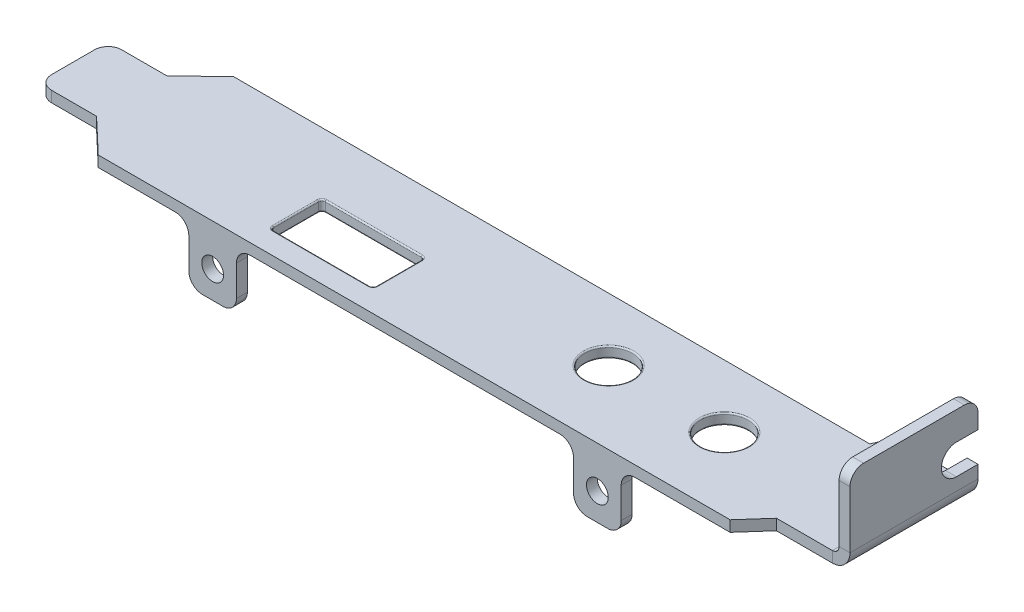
ISO-10303-21;
HEADER;
FILE_DESCRIPTION(('STEP AP214'),'2;1');
FILE_NAME('part.step','',(''),(''),'','','');
FILE_SCHEMA(('AUTOMOTIVE_DESIGN { 1 0 10303 214 1 1 1 1 }'));
ENDSEC;
DATA;
#1=APPLICATION_CONTEXT('core data for automotive mechanical design processes');
#2=APPLICATION_PROTOCOL_DEFINITION('international standard','automotive_design',2000,#1);
#3=PRODUCT_CONTEXT('',#1,'mechanical');
#4=PRODUCT('Part','Part','',(#3));
#5=PRODUCT_RELATED_PRODUCT_CATEGORY('part','',(#4));
#6=PRODUCT_DEFINITION_FORMATION('','',#4);
#7=PRODUCT_DEFINITION_CONTEXT('part definition',#1,'design');
#8=PRODUCT_DEFINITION('design','',#6,#7);
#9=PRODUCT_DEFINITION_SHAPE('','',#8);
#10=(LENGTH_UNIT() NAMED_UNIT(*) SI_UNIT(.MILLI.,.METRE.));
#11=(NAMED_UNIT(*) PLANE_ANGLE_UNIT() SI_UNIT($,.RADIAN.));
#12=(NAMED_UNIT(*) SI_UNIT($,.STERADIAN.) SOLID_ANGLE_UNIT());
#13=UNCERTAINTY_MEASURE_WITH_UNIT(LENGTH_MEASURE(1.E-05),#10,'distance_accuracy_value','');
#14=(GEOMETRIC_REPRESENTATION_CONTEXT(3) GLOBAL_UNCERTAINTY_ASSIGNED_CONTEXT((#13)) GLOBAL_UNIT_ASSIGNED_CONTEXT((#10,
#11,#12)) REPRESENTATION_CONTEXT('',''));
#15=CARTESIAN_POINT('',(0.,0.,0.));
#16=DIRECTION('',(0.,0.,1.));
#17=DIRECTION('',(1.,0.,0.));
#18=AXIS2_PLACEMENT_3D('',#15,#16,#17);
#19=CARTESIAN_POINT('',(0.,13.,0.));
#20=DIRECTION('',(0.,0.,1.));
#21=DIRECTION('',(0.,1.,0.));
#22=AXIS2_PLACEMENT_3D('',#19,#20,#21);
#23=PLANE('',#22);
#24=DIRECTION('',(-1.,0.,0.));
#25=VECTOR('',#24,1.);
#26=CARTESIAN_POINT('',(0.,4.46,0.));
#27=LINE('',#26,#25);
#28=CARTESIAN_POINT('',(0.,4.46,0.));
#29=VERTEX_POINT('',#28);
#30=CARTESIAN_POINT('',(-1.6,4.46,0.));
#31=VERTEX_POINT('',#30);
#32=EDGE_CURVE('E435',#29,#31,#27,.T.);
#33=ORIENTED_EDGE('',*,*,#32,.F.);
#34=DIRECTION('',(0.,1.,0.));
#35=VECTOR('',#34,1.);
#36=CARTESIAN_POINT('',(0.,13.,0.));
#37=LINE('',#36,#35);
#38=CARTESIAN_POINT('',(0.,2.6,0.));
#39=VERTEX_POINT('',#38);
#40=EDGE_CURVE('E516',#39,#29,#37,.T.);
#41=ORIENTED_EDGE('',*,*,#40,.F.);
#42=DIRECTION('',(1.,0.,0.));
#43=VECTOR('',#42,1.);
#44=CARTESIAN_POINT('',(0.,2.6,0.));
#45=LINE('',#44,#43);
#46=CARTESIAN_POINT('',(-1.6,2.6,0.));
#47=VERTEX_POINT('',#46);
#48=EDGE_CURVE('E562',#47,#39,#45,.T.);
#49=ORIENTED_EDGE('',*,*,#48,.F.);
#50=DIRECTION('',(0.,-1.,0.));
#51=VECTOR('',#50,1.);
#52=CARTESIAN_POINT('',(-1.6,13.,0.));
#53=LINE('',#52,#51);
#54=EDGE_CURVE('E556',#47,#31,#53,.F.);
#55=ORIENTED_EDGE('',*,*,#54,.T.);
#56=EDGE_LOOP('',(#33,#41,#49,#55));
#57=FACE_BOUND('',#56,.T.);
#58=ADVANCED_FACE('F38',(#57),#23,.F.);
#59=CARTESIAN_POINT('',(0.,0.,22.4));
#60=DIRECTION('',(0.,1.,0.));
#61=DIRECTION('',(-1.,0.,0.));
#62=AXIS2_PLACEMENT_3D('',#59,#60,#61);
#63=PLANE('',#62);
#64=CARTESIAN_POINT('',(-25.55,0.,11.7));
#65=DIRECTION('',(0.,1.,0.));
#66=DIRECTION('',(-1.,0.,0.));
#67=AXIS2_PLACEMENT_3D('',#64,#65,#66);
#68=CIRCLE('',#67,3.7);
#69=CARTESIAN_POINT('',(-29.25,0.,11.7));
#70=VERTEX_POINT('',#69);
#71=EDGE_CURVE('E725',#70,#70,#68,.T.);
#72=ORIENTED_EDGE('',*,*,#71,.T.);
#73=EDGE_LOOP('',(#72));
#74=FACE_BOUND('',#73,.T.);
#75=DIRECTION('',(-1.,0.,0.));
#76=VECTOR('',#75,1.);
#77=CARTESIAN_POINT('',(0.,0.,19.3));
#78=LINE('',#77,#76);
#79=CARTESIAN_POINT('',(-84.35,0.,19.3));
#80=VERTEX_POINT('',#79);
#81=CARTESIAN_POINT('',(-70.25,0.,19.3));
#82=VERTEX_POINT('',#81);
#83=EDGE_CURVE('E708',#80,#82,#78,.F.);
#84=ORIENTED_EDGE('',*,*,#83,.T.);
#85=CARTESIAN_POINT('',(-70.25,0.,18.6));
#86=DIRECTION('',(0.,1.,0.));
#87=DIRECTION('',(-1.,0.,0.));
#88=AXIS2_PLACEMENT_3D('',#85,#86,#87);
#89=CIRCLE('',#88,0.7);
#90=CARTESIAN_POINT('',(-69.55,0.,18.6));
#91=VERTEX_POINT('',#90);
#92=EDGE_CURVE('E722',#82,#91,#89,.T.);
#93=ORIENTED_EDGE('',*,*,#92,.T.);
#94=DIRECTION('',(0.,0.,1.));
#95=VECTOR('',#94,1.);
#96=CARTESIAN_POINT('',(-69.55,0.,22.4));
#97=LINE('',#96,#95);
#98=CARTESIAN_POINT('',(-69.55,0.,12.));
#99=VERTEX_POINT('',#98);
#100=EDGE_CURVE('E720',#91,#99,#97,.F.);
#101=ORIENTED_EDGE('',*,*,#100,.T.);
#102=CARTESIAN_POINT('',(-70.25,0.,12.));
#103=DIRECTION('',(0.,1.,0.));
#104=DIRECTION('',(-1.,0.,0.));
#105=AXIS2_PLACEMENT_3D('',#102,#103,#104);
#106=CIRCLE('',#105,0.7);
#107=CARTESIAN_POINT('',(-70.25,0.,11.3));
#108=VERTEX_POINT('',#107);
#109=EDGE_CURVE('E718',#99,#108,#106,.T.);
#110=ORIENTED_EDGE('',*,*,#109,.T.);
#111=DIRECTION('',(1.,0.,0.));
#112=VECTOR('',#111,1.);
#113=CARTESIAN_POINT('',(0.,0.,11.3));
#114=LINE('',#113,#112);
#115=CARTESIAN_POINT('',(-84.35,0.,11.3));
#116=VERTEX_POINT('',#115);
#117=EDGE_CURVE('E716',#108,#116,#114,.F.);
#118=ORIENTED_EDGE('',*,*,#117,.T.);
#119=CARTESIAN_POINT('',(-84.35,0.,12.));
#120=DIRECTION('',(0.,1.,0.));
#121=DIRECTION('',(-1.,0.,0.));
#122=AXIS2_PLACEMENT_3D('',#119,#120,#121);
#123=CIRCLE('',#122,0.7);
#124=CARTESIAN_POINT('',(-85.05,0.,12.));
#125=VERTEX_POINT('',#124);
#126=EDGE_CURVE('E714',#116,#125,#123,.T.);
#127=ORIENTED_EDGE('',*,*,#126,.T.);
#128=DIRECTION('',(0.,0.,-1.));
#129=VECTOR('',#128,1.);
#130=CARTESIAN_POINT('',(-85.05,0.,22.4));
#131=LINE('',#130,#129);
#132=CARTESIAN_POINT('',(-85.05,0.,18.6));
#133=VERTEX_POINT('',#132);
#134=EDGE_CURVE('E712',#125,#133,#131,.F.);
#135=ORIENTED_EDGE('',*,*,#134,.T.);
#136=CARTESIAN_POINT('',(-84.35,0.,18.6));
#137=DIRECTION('',(0.,1.,0.));
#138=DIRECTION('',(-1.,0.,0.));
#139=AXIS2_PLACEMENT_3D('',#136,#137,#138);
#140=CIRCLE('',#139,0.7);
#141=EDGE_CURVE('E710',#133,#80,#140,.T.);
#142=ORIENTED_EDGE('',*,*,#141,.T.);
#143=EDGE_LOOP('',(#84,#93,#101,#110,#118,#127,#135,#142));
#144=FACE_BOUND('',#143,.T.);
#145=CARTESIAN_POINT('',(-42.55,0.,11.7));
#146=DIRECTION('',(0.,1.,0.));
#147=DIRECTION('',(-1.,0.,0.));
#148=AXIS2_PLACEMENT_3D('',#145,#146,#147);
#149=CIRCLE('',#148,3.7);
#150=CARTESIAN_POINT('',(-46.25,0.,11.7));
#151=VERTEX_POINT('',#150);
#152=EDGE_CURVE('E705',#151,#151,#149,.T.);
#153=ORIENTED_EDGE('',*,*,#152,.T.);
#154=EDGE_LOOP('',(#153));
#155=FACE_BOUND('',#154,.T.);
#156=DIRECTION('',(1.,0.,0.));
#157=VECTOR('',#156,1.);
#158=CARTESIAN_POINT('',(0.,0.,22.4));
#159=LINE('',#158,#157);
#160=CARTESIAN_POINT('',(-84.5,0.,22.4));
#161=VERTEX_POINT('',#160);
#162=CARTESIAN_POINT('',(-39.,0.,22.4));
#163=VERTEX_POINT('',#162);
#164=EDGE_CURVE('E529',#161,#163,#159,.T.);
#165=ORIENTED_EDGE('',*,*,#164,.F.);
#166=DIRECTION('',(0.,0.,1.));
#167=VECTOR('',#166,1.);
#168=CARTESIAN_POINT('',(-84.5,0.,22.4));
#169=LINE('',#168,#167);
#170=CARTESIAN_POINT('',(-84.5,-4.09866470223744E-13,20.8));
#171=VERTEX_POINT('',#170);
#172=EDGE_CURVE('E653',#161,#171,#169,.F.);
#173=ORIENTED_EDGE('',*,*,#172,.T.);
#174=DIRECTION('',(-1.,0.,0.));
#175=VECTOR('',#174,1.);
#176=CARTESIAN_POINT('',(-86.5,-4.07616619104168E-13,20.8));
#177=LINE('',#176,#175);
#178=CARTESIAN_POINT('',(-95.5,-3.97492289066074E-13,20.8));
#179=VERTEX_POINT('',#178);
#180=EDGE_CURVE('E1711',#171,#179,#177,.T.);
#181=ORIENTED_EDGE('',*,*,#180,.T.);
#182=DIRECTION('',(0.,0.,1.));
#183=VECTOR('',#182,1.);
#184=CARTESIAN_POINT('',(-95.5,0.,22.4));
#185=LINE('',#184,#183);
#186=CARTESIAN_POINT('',(-95.5,0.,22.4));
#187=VERTEX_POINT('',#186);
#188=EDGE_CURVE('E650',#179,#187,#185,.T.);
#189=ORIENTED_EDGE('',*,*,#188,.T.);
#190=CARTESIAN_POINT('',(-106.8,0.,22.4));
#191=VERTEX_POINT('',#190);
#192=EDGE_CURVE('E525',#191,#187,#159,.T.);
#193=ORIENTED_EDGE('',*,*,#192,.F.);
#194=DIRECTION('',(-0.72482023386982,0.,-0.688938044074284));
#195=VECTOR('',#194,1.);
#196=CARTESIAN_POINT('',(-50.6910851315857,0.,75.7312458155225));
#197=LINE('',#196,#195);
#198=CARTESIAN_POINT('',(-111.85,0.,17.6));
#199=VERTEX_POINT('',#198);
#200=EDGE_CURVE('E459',#191,#199,#197,.T.);
#201=ORIENTED_EDGE('',*,*,#200,.T.);
#202=DIRECTION('',(-1.,0.,0.));
#203=VECTOR('',#202,1.);
#204=CARTESIAN_POINT('',(0.,0.,17.6));
#205=LINE('',#204,#203);
#206=CARTESIAN_POINT('',(-118.45,0.,17.6));
#207=VERTEX_POINT('',#206);
#208=EDGE_CURVE('E434',#199,#207,#205,.T.);
#209=ORIENTED_EDGE('',*,*,#208,.T.);
#210=CARTESIAN_POINT('',(-118.45,0.,15.6));
#211=DIRECTION('',(0.,1.,0.));
#212=DIRECTION('',(-1.,0.,0.));
#213=AXIS2_PLACEMENT_3D('',#210,#211,#212);
#214=CIRCLE('',#213,2.);
#215=CARTESIAN_POINT('',(-120.45,0.,15.6));
#216=VERTEX_POINT('',#215);
#217=EDGE_CURVE('E579',#207,#216,#214,.F.);
#218=ORIENTED_EDGE('',*,*,#217,.T.);
#219=DIRECTION('',(0.,0.,-1.));
#220=VECTOR('',#219,1.);
#221=CARTESIAN_POINT('',(-120.45,0.,22.4));
#222=LINE('',#221,#220);
#223=CARTESIAN_POINT('',(-120.45,0.,9.30000000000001));
#224=VERTEX_POINT('',#223);
#225=EDGE_CURVE('E528',#216,#224,#222,.T.);
#226=ORIENTED_EDGE('',*,*,#225,.T.);
#227=CARTESIAN_POINT('',(-118.45,0.,9.30000000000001));
#228=DIRECTION('',(0.,1.,0.));
#229=DIRECTION('',(-1.,0.,0.));
#230=AXIS2_PLACEMENT_3D('',#227,#228,#229);
#231=CIRCLE('',#230,2.);
#232=CARTESIAN_POINT('',(-118.45,0.,7.30000000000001));
#233=VERTEX_POINT('',#232);
#234=EDGE_CURVE('E581',#224,#233,#231,.F.);
#235=ORIENTED_EDGE('',*,*,#234,.T.);
#236=DIRECTION('',(1.,0.,0.));
#237=VECTOR('',#236,1.);
#238=CARTESIAN_POINT('',(0.,0.,7.30000000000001));
#239=LINE('',#238,#237);
#240=CARTESIAN_POINT('',(-111.85,0.,7.30000000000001));
#241=VERTEX_POINT('',#240);
#242=EDGE_CURVE('E444',#233,#241,#239,.T.);
#243=ORIENTED_EDGE('',*,*,#242,.T.);
#244=DIRECTION('',(0.72482023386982,0.,-0.688938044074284));
#245=VECTOR('',#244,1.);
#246=CARTESIAN_POINT('',(-60.6282741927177,0.,-41.3859968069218));
#247=LINE('',#246,#245);
#248=CARTESIAN_POINT('',(-106.8,0.,2.50000000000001));
#249=VERTEX_POINT('',#248);
#250=EDGE_CURVE('E441',#241,#249,#247,.T.);
#251=ORIENTED_EDGE('',*,*,#250,.T.);
#252=DIRECTION('',(-1.,0.,0.));
#253=VECTOR('',#252,1.);
#254=CARTESIAN_POINT('',(0.,0.,2.50000000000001));
#255=LINE('',#254,#253);
#256=CARTESIAN_POINT('',(-13.4,0.,2.5));
#257=VERTEX_POINT('',#256);
#258=EDGE_CURVE('E469',#249,#257,#255,.F.);
#259=ORIENTED_EDGE('',*,*,#258,.T.);
#260=DIRECTION('',(0.402738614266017,0.,-0.915315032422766));
#261=VECTOR('',#260,1.);
#262=CARTESIAN_POINT('',(-18.5623324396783,0.,14.2325737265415));
#263=LINE('',#262,#261);
#264=CARTESIAN_POINT('',(-12.3,0.,0.));
#265=VERTEX_POINT('',#264);
#266=EDGE_CURVE('E471',#257,#265,#263,.T.);
#267=ORIENTED_EDGE('',*,*,#266,.T.);
#268=DIRECTION('',(1.,0.,0.));
#269=VECTOR('',#268,1.);
#270=CARTESIAN_POINT('',(0.,0.,0.));
#271=LINE('',#270,#269);
#272=CARTESIAN_POINT('',(-2.6,0.,0.));
#273=VERTEX_POINT('',#272);
#274=EDGE_CURVE('E522',#265,#273,#271,.T.);
#275=ORIENTED_EDGE('',*,*,#274,.T.);
#276=DIRECTION('',(0.,0.,-1.));
#277=VECTOR('',#276,1.);
#278=CARTESIAN_POINT('',(-2.6,0.,22.4));
#279=LINE('',#278,#277);
#280=CARTESIAN_POINT('',(-2.6,0.,18.8));
#281=VERTEX_POINT('',#280);
#282=EDGE_CURVE('E534',#273,#281,#279,.F.);
#283=ORIENTED_EDGE('',*,*,#282,.T.);
#284=DIRECTION('',(-1.,0.,0.));
#285=VECTOR('',#284,1.);
#286=CARTESIAN_POINT('',(0.,0.,18.8));
#287=LINE('',#286,#285);
#288=CARTESIAN_POINT('',(-10.8,0.,18.8));
#289=VERTEX_POINT('',#288);
#290=EDGE_CURVE('E496',#281,#289,#287,.T.);
#291=ORIENTED_EDGE('',*,*,#290,.T.);
#292=DIRECTION('',(-0.66436383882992,0.,0.747409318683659));
#293=VECTOR('',#292,1.);
#294=CARTESIAN_POINT('',(-7.82068965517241,0.,15.448275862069));
#295=LINE('',#294,#293);
#296=CARTESIAN_POINT('',(-14.,0.,22.4));
#297=VERTEX_POINT('',#296);
#298=EDGE_CURVE('E499',#289,#297,#295,.T.);
#299=ORIENTED_EDGE('',*,*,#298,.T.);
#300=CARTESIAN_POINT('',(-28.,0.,22.4));
#301=VERTEX_POINT('',#300);
#302=EDGE_CURVE('E524',#301,#297,#159,.T.);
#303=ORIENTED_EDGE('',*,*,#302,.F.);
#304=DIRECTION('',(0.,0.,1.));
#305=VECTOR('',#304,1.);
#306=CARTESIAN_POINT('',(-28.,0.,22.4));
#307=LINE('',#306,#305);
#308=CARTESIAN_POINT('',(-28.,0.,20.8));
#309=VERTEX_POINT('',#308);
#310=EDGE_CURVE('E644',#301,#309,#307,.F.);
#311=ORIENTED_EDGE('',*,*,#310,.T.);
#312=DIRECTION('',(-1.,0.,0.));
#313=VECTOR('',#312,1.);
#314=CARTESIAN_POINT('',(-30.,0.,20.8));
#315=LINE('',#314,#313);
#316=CARTESIAN_POINT('',(-39.,0.,20.8));
#317=VERTEX_POINT('',#316);
#318=EDGE_CURVE('E1740',#309,#317,#315,.T.);
#319=ORIENTED_EDGE('',*,*,#318,.T.);
#320=DIRECTION('',(0.,0.,1.));
#321=VECTOR('',#320,1.);
#322=CARTESIAN_POINT('',(-39.,0.,22.4));
#323=LINE('',#322,#321);
#324=EDGE_CURVE('E647',#317,#163,#323,.T.);
#325=ORIENTED_EDGE('',*,*,#324,.T.);
#326=EDGE_LOOP('',(#165,#173,#181,#189,#193,#201,#209,#218,#226,#235,#243,#251,#259,#267,#275,
#283,#291,#299,#303,#311,#319,#325));
#327=FACE_BOUND('',#326,.T.);
#328=ADVANCED_FACE('F882',(#74,#144,#155,#327),#63,.F.);
#329=CARTESIAN_POINT('',(0.,1.6,22.4));
#330=DIRECTION('',(0.,1.,0.));
#331=DIRECTION('',(-1.,0.,0.));
#332=AXIS2_PLACEMENT_3D('',#329,#330,#331);
#333=PLANE('',#332);
#334=CARTESIAN_POINT('',(-25.55,1.6,11.7));
#335=DIRECTION('',(0.,1.,0.));
#336=DIRECTION('',(-1.,0.,0.));
#337=AXIS2_PLACEMENT_3D('',#334,#335,#336);
#338=CIRCLE('',#337,3.7);
#339=CARTESIAN_POINT('',(-29.25,1.6,11.7));
#340=VERTEX_POINT('',#339);
#341=EDGE_CURVE('E776',#340,#340,#338,.F.);
#342=ORIENTED_EDGE('',*,*,#341,.T.);
#343=EDGE_LOOP('',(#342));
#344=FACE_BOUND('',#343,.T.);
#345=DIRECTION('',(1.,0.,0.));
#346=VECTOR('',#345,1.);
#347=CARTESIAN_POINT('',(-84.35,1.59999999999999,19.3));
#348=LINE('',#347,#346);
#349=CARTESIAN_POINT('',(-70.25,1.59999999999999,19.3));
#350=VERTEX_POINT('',#349);
#351=CARTESIAN_POINT('',(-84.35,1.59999999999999,19.3));
#352=VERTEX_POINT('',#351);
#353=EDGE_CURVE('E761',#350,#352,#348,.F.);
#354=ORIENTED_EDGE('',*,*,#353,.T.);
#355=CARTESIAN_POINT('',(-84.35,1.59999999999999,18.6));
#356=DIRECTION('',(0.,1.,0.));
#357=DIRECTION('',(-1.,0.,0.));
#358=AXIS2_PLACEMENT_3D('',#355,#356,#357);
#359=CIRCLE('',#358,0.7);
#360=CARTESIAN_POINT('',(-85.05,1.59999999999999,18.6));
#361=VERTEX_POINT('',#360);
#362=EDGE_CURVE('E774',#352,#361,#359,.F.);
#363=ORIENTED_EDGE('',*,*,#362,.T.);
#364=DIRECTION('',(0.,0.,1.));
#365=VECTOR('',#364,1.);
#366=CARTESIAN_POINT('',(-85.05,1.59999999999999,12.));
#367=LINE('',#366,#365);
#368=CARTESIAN_POINT('',(-85.05,1.59999999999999,12.));
#369=VERTEX_POINT('',#368);
#370=EDGE_CURVE('E62',#361,#369,#367,.F.);
#371=ORIENTED_EDGE('',*,*,#370,.T.);
#372=CARTESIAN_POINT('',(-84.35,1.59999999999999,12.));
#373=DIRECTION('',(0.,1.,0.));
#374=DIRECTION('',(-1.,0.,0.));
#375=AXIS2_PLACEMENT_3D('',#372,#373,#374);
#376=CIRCLE('',#375,0.7);
#377=CARTESIAN_POINT('',(-84.35,1.59999999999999,11.3));
#378=VERTEX_POINT('',#377);
#379=EDGE_CURVE('E771',#369,#378,#376,.F.);
#380=ORIENTED_EDGE('',*,*,#379,.T.);
#381=DIRECTION('',(-1.,0.,0.));
#382=VECTOR('',#381,1.);
#383=CARTESIAN_POINT('',(-70.25,1.59999999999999,11.3));
#384=LINE('',#383,#382);
#385=CARTESIAN_POINT('',(-70.25,1.59999999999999,11.3));
#386=VERTEX_POINT('',#385);
#387=EDGE_CURVE('E769',#378,#386,#384,.F.);
#388=ORIENTED_EDGE('',*,*,#387,.T.);
#389=CARTESIAN_POINT('',(-70.25,1.59999999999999,12.));
#390=DIRECTION('',(0.,1.,0.));
#391=DIRECTION('',(-1.,0.,0.));
#392=AXIS2_PLACEMENT_3D('',#389,#390,#391);
#393=CIRCLE('',#392,0.7);
#394=CARTESIAN_POINT('',(-69.55,1.59999999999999,12.));
#395=VERTEX_POINT('',#394);
#396=EDGE_CURVE('E767',#386,#395,#393,.F.);
#397=ORIENTED_EDGE('',*,*,#396,.T.);
#398=DIRECTION('',(0.,0.,-1.));
#399=VECTOR('',#398,1.);
#400=CARTESIAN_POINT('',(-69.55,1.59999999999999,18.6));
#401=LINE('',#400,#399);
#402=CARTESIAN_POINT('',(-69.55,1.59999999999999,18.6));
#403=VERTEX_POINT('',#402);
#404=EDGE_CURVE('E765',#395,#403,#401,.F.);
#405=ORIENTED_EDGE('',*,*,#404,.T.);
#406=CARTESIAN_POINT('',(-70.25,1.59999999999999,18.6));
#407=DIRECTION('',(0.,1.,0.));
#408=DIRECTION('',(-1.,0.,0.));
#409=AXIS2_PLACEMENT_3D('',#406,#407,#408);
#410=CIRCLE('',#409,0.7);
#411=EDGE_CURVE('E763',#403,#350,#410,.F.);
#412=ORIENTED_EDGE('',*,*,#411,.T.);
#413=EDGE_LOOP('',(#354,#363,#371,#380,#388,#397,#405,#412));
#414=FACE_BOUND('',#413,.T.);
#415=CARTESIAN_POINT('',(-42.55,1.59999999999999,11.7));
#416=DIRECTION('',(0.,1.,0.));
#417=DIRECTION('',(-1.,0.,0.));
#418=AXIS2_PLACEMENT_3D('',#415,#416,#417);
#419=CIRCLE('',#418,3.7);
#420=CARTESIAN_POINT('',(-46.25,1.59999999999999,11.7));
#421=VERTEX_POINT('',#420);
#422=EDGE_CURVE('E758',#421,#421,#419,.F.);
#423=ORIENTED_EDGE('',*,*,#422,.T.);
#424=EDGE_LOOP('',(#423));
#425=FACE_BOUND('',#424,.T.);
#426=DIRECTION('',(-1.,0.,0.));
#427=VECTOR('',#426,1.);
#428=CARTESIAN_POINT('',(0.,1.6,7.30000000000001));
#429=LINE('',#428,#427);
#430=CARTESIAN_POINT('',(-118.45,1.59999999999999,7.30000000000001));
#431=VERTEX_POINT('',#430);
#432=CARTESIAN_POINT('',(-111.85,1.59999999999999,7.30000000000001));
#433=VERTEX_POINT('',#432);
#434=EDGE_CURVE('E438',#431,#433,#429,.F.);
#435=ORIENTED_EDGE('',*,*,#434,.F.);
#436=CARTESIAN_POINT('',(-118.45,1.59999999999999,9.30000000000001));
#437=DIRECTION('',(0.,1.,0.));
#438=DIRECTION('',(-1.,0.,0.));
#439=AXIS2_PLACEMENT_3D('',#436,#437,#438);
#440=CIRCLE('',#439,2.);
#441=CARTESIAN_POINT('',(-120.45,1.59999999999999,9.30000000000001));
#442=VERTEX_POINT('',#441);
#443=EDGE_CURVE('E572',#431,#442,#440,.T.);
#444=ORIENTED_EDGE('',*,*,#443,.T.);
#445=DIRECTION('',(0.,0.,1.));
#446=VECTOR('',#445,1.);
#447=CARTESIAN_POINT('',(-120.45,1.59999999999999,22.4));
#448=LINE('',#447,#446);
#449=CARTESIAN_POINT('',(-120.45,1.59999999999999,15.6));
#450=VERTEX_POINT('',#449);
#451=EDGE_CURVE('E546',#450,#442,#448,.F.);
#452=ORIENTED_EDGE('',*,*,#451,.F.);
#453=CARTESIAN_POINT('',(-118.45,1.59999999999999,15.6));
#454=DIRECTION('',(0.,1.,0.));
#455=DIRECTION('',(-1.,0.,0.));
#456=AXIS2_PLACEMENT_3D('',#453,#454,#455);
#457=CIRCLE('',#456,2.);
#458=CARTESIAN_POINT('',(-118.45,1.59999999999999,17.6));
#459=VERTEX_POINT('',#458);
#460=EDGE_CURVE('E570',#450,#459,#457,.T.);
#461=ORIENTED_EDGE('',*,*,#460,.T.);
#462=DIRECTION('',(-1.,0.,0.));
#463=VECTOR('',#462,1.);
#464=CARTESIAN_POINT('',(0.,1.6,17.6));
#465=LINE('',#464,#463);
#466=CARTESIAN_POINT('',(-111.85,1.59999999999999,17.6));
#467=VERTEX_POINT('',#466);
#468=EDGE_CURVE('E455',#467,#459,#465,.T.);
#469=ORIENTED_EDGE('',*,*,#468,.F.);
#470=DIRECTION('',(-0.72482023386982,0.,-0.688938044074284));
#471=VECTOR('',#470,1.);
#472=CARTESIAN_POINT('',(-50.6910851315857,1.59999999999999,75.7312458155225));
#473=LINE('',#472,#471);
#474=CARTESIAN_POINT('',(-106.8,1.59999999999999,22.4));
#475=VERTEX_POINT('',#474);
#476=EDGE_CURVE('E458',#475,#467,#473,.T.);
#477=ORIENTED_EDGE('',*,*,#476,.F.);
#478=DIRECTION('',(-1.,0.,0.));
#479=VECTOR('',#478,1.);
#480=CARTESIAN_POINT('',(0.,1.6,22.4));
#481=LINE('',#480,#479);
#482=CARTESIAN_POINT('',(-14.,1.6,22.4));
#483=VERTEX_POINT('',#482);
#484=EDGE_CURVE('E549',#475,#483,#481,.F.);
#485=ORIENTED_EDGE('',*,*,#484,.T.);
#486=DIRECTION('',(-0.66436383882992,0.,0.747409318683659));
#487=VECTOR('',#486,1.);
#488=CARTESIAN_POINT('',(-7.82068965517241,1.6,15.448275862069));
#489=LINE('',#488,#487);
#490=CARTESIAN_POINT('',(-10.8,1.6,18.8));
#491=VERTEX_POINT('',#490);
#492=EDGE_CURVE('E500',#491,#483,#489,.T.);
#493=ORIENTED_EDGE('',*,*,#492,.F.);
#494=DIRECTION('',(-1.,0.,0.));
#495=VECTOR('',#494,1.);
#496=CARTESIAN_POINT('',(0.,1.6,18.8));
#497=LINE('',#496,#495);
#498=CARTESIAN_POINT('',(-2.6,1.6,18.8));
#499=VERTEX_POINT('',#498);
#500=EDGE_CURVE('E495',#499,#491,#497,.T.);
#501=ORIENTED_EDGE('',*,*,#500,.F.);
#502=DIRECTION('',(0.,0.,1.));
#503=VECTOR('',#502,1.);
#504=CARTESIAN_POINT('',(-2.6,1.6,22.4));
#505=LINE('',#504,#503);
#506=CARTESIAN_POINT('',(-2.6,1.6,0.));
#507=VERTEX_POINT('',#506);
#508=EDGE_CURVE('E541',#507,#499,#505,.T.);
#509=ORIENTED_EDGE('',*,*,#508,.F.);
#510=DIRECTION('',(-1.,0.,0.));
#511=VECTOR('',#510,1.);
#512=CARTESIAN_POINT('',(0.,1.6,0.));
#513=LINE('',#512,#511);
#514=CARTESIAN_POINT('',(-12.3,1.6,0.));
#515=VERTEX_POINT('',#514);
#516=EDGE_CURVE('E547',#515,#507,#513,.F.);
#517=ORIENTED_EDGE('',*,*,#516,.F.);
#518=DIRECTION('',(0.402738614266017,0.,-0.915315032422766));
#519=VECTOR('',#518,1.);
#520=CARTESIAN_POINT('',(-18.5623324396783,1.6,14.2325737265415));
#521=LINE('',#520,#519);
#522=CARTESIAN_POINT('',(-13.4,1.59999999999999,2.5));
#523=VERTEX_POINT('',#522);
#524=EDGE_CURVE('E472',#523,#515,#521,.T.);
#525=ORIENTED_EDGE('',*,*,#524,.F.);
#526=DIRECTION('',(1.,0.,0.));
#527=VECTOR('',#526,1.);
#528=CARTESIAN_POINT('',(0.,1.6,2.5));
#529=LINE('',#528,#527);
#530=CARTESIAN_POINT('',(-106.8,1.59999999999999,2.50000000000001));
#531=VERTEX_POINT('',#530);
#532=EDGE_CURVE('E454',#531,#523,#529,.T.);
#533=ORIENTED_EDGE('',*,*,#532,.F.);
#534=DIRECTION('',(0.72482023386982,0.,-0.688938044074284));
#535=VECTOR('',#534,1.);
#536=CARTESIAN_POINT('',(-60.6282741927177,1.59999999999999,-41.3859968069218));
#537=LINE('',#536,#535);
#538=EDGE_CURVE('E440',#433,#531,#537,.T.);
#539=ORIENTED_EDGE('',*,*,#538,.F.);
#540=EDGE_LOOP('',(#435,#444,#452,#461,#469,#477,#485,#493,#501,#509,#517,#525,#533,#539));
#541=FACE_BOUND('',#540,.T.);
#542=ADVANCED_FACE('F933',(#344,#414,#425,#541),#333,.T.);
#543=CARTESIAN_POINT('',(-120.45,0.,22.4));
#544=DIRECTION('',(1.,0.,0.));
#545=DIRECTION('',(0.,0.,-1.));
#546=AXIS2_PLACEMENT_3D('',#543,#544,#545);
#547=PLANE('',#546);
#548=ORIENTED_EDGE('',*,*,#451,.T.);
#549=DIRECTION('',(0.,-1.,0.));
#550=VECTOR('',#549,1.);
#551=CARTESIAN_POINT('',(-120.45,0.,9.30000000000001));
#552=LINE('',#551,#550);
#553=EDGE_CURVE('E577',#442,#224,#552,.T.);
#554=ORIENTED_EDGE('',*,*,#553,.T.);
#555=ORIENTED_EDGE('',*,*,#225,.F.);
#556=DIRECTION('',(0.,-1.,0.));
#557=VECTOR('',#556,1.);
#558=CARTESIAN_POINT('',(-120.45,0.,15.6));
#559=LINE('',#558,#557);
#560=EDGE_CURVE('E574',#216,#450,#559,.F.);
#561=ORIENTED_EDGE('',*,*,#560,.T.);
#562=EDGE_LOOP('',(#548,#554,#555,#561));
#563=FACE_BOUND('',#562,.T.);
#564=ADVANCED_FACE('F1048',(#563),#547,.F.);
#565=CARTESIAN_POINT('',(0.,0.,22.4));
#566=DIRECTION('',(0.,0.,1.));
#567=DIRECTION('',(1.,0.,0.));
#568=AXIS2_PLACEMENT_3D('',#565,#566,#567);
#569=PLANE('',#568);
#570=ORIENTED_EDGE('',*,*,#192,.T.);
#571=CARTESIAN_POINT('',(-95.5,-2.00000000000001,22.4));
#572=DIRECTION('',(0.,0.,1.));
#573=DIRECTION('',(1.,0.,0.));
#574=AXIS2_PLACEMENT_3D('',#571,#572,#573);
#575=CIRCLE('',#574,2.);
#576=CARTESIAN_POINT('',(-93.5,-2.00000000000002,22.4));
#577=VERTEX_POINT('',#576);
#578=EDGE_CURVE('E667',#187,#577,#575,.F.);
#579=ORIENTED_EDGE('',*,*,#578,.T.);
#580=DIRECTION('',(0.,-1.,0.));
#581=VECTOR('',#580,1.);
#582=CARTESIAN_POINT('',(-93.5,-3.9974214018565E-13,22.4));
#583=LINE('',#582,#581);
#584=CARTESIAN_POINT('',(-93.5,-6.50000000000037,22.4));
#585=VERTEX_POINT('',#584);
#586=EDGE_CURVE('E1726',#577,#585,#583,.T.);
#587=ORIENTED_EDGE('',*,*,#586,.T.);
#588=CARTESIAN_POINT('',(-91.5,-6.50000000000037,22.4));
#589=DIRECTION('',(0.,0.,1.));
#590=DIRECTION('',(1.,0.,0.));
#591=AXIS2_PLACEMENT_3D('',#588,#589,#590);
#592=CIRCLE('',#591,2.);
#593=CARTESIAN_POINT('',(-91.5,-8.50000000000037,22.4));
#594=VERTEX_POINT('',#593);
#595=EDGE_CURVE('E612',#585,#594,#592,.T.);
#596=ORIENTED_EDGE('',*,*,#595,.T.);
#597=DIRECTION('',(1.,0.,0.));
#598=VECTOR('',#597,1.);
#599=CARTESIAN_POINT('',(-86.5,-8.50000000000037,22.4));
#600=LINE('',#599,#598);
#601=CARTESIAN_POINT('',(-88.5,-8.50000000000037,22.4));
#602=VERTEX_POINT('',#601);
#603=EDGE_CURVE('E1728',#594,#602,#600,.T.);
#604=ORIENTED_EDGE('',*,*,#603,.T.);
#605=CARTESIAN_POINT('',(-88.5,-6.50000000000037,22.4));
#606=DIRECTION('',(0.,0.,1.));
#607=DIRECTION('',(1.,0.,0.));
#608=AXIS2_PLACEMENT_3D('',#605,#606,#607);
#609=CIRCLE('',#608,2.);
#610=CARTESIAN_POINT('',(-86.5,-6.50000000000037,22.4));
#611=VERTEX_POINT('',#610);
#612=EDGE_CURVE('E610',#602,#611,#609,.T.);
#613=ORIENTED_EDGE('',*,*,#612,.T.);
#614=DIRECTION('',(0.,1.,0.));
#615=VECTOR('',#614,1.);
#616=CARTESIAN_POINT('',(-86.5,-4.07616619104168E-13,22.4));
#617=LINE('',#616,#615);
#618=CARTESIAN_POINT('',(-86.5,-2.00000000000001,22.4));
#619=VERTEX_POINT('',#618);
#620=EDGE_CURVE('E1732',#611,#619,#617,.T.);
#621=ORIENTED_EDGE('',*,*,#620,.T.);
#622=CARTESIAN_POINT('',(-84.5,-2.00000000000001,22.4));
#623=DIRECTION('',(0.,0.,1.));
#624=DIRECTION('',(1.,0.,0.));
#625=AXIS2_PLACEMENT_3D('',#622,#623,#624);
#626=CIRCLE('',#625,2.);
#627=EDGE_CURVE('E663',#619,#161,#626,.F.);
#628=ORIENTED_EDGE('',*,*,#627,.T.);
#629=ORIENTED_EDGE('',*,*,#164,.T.);
#630=CARTESIAN_POINT('',(-39.,-2.,22.4));
#631=DIRECTION('',(0.,0.,1.));
#632=DIRECTION('',(1.,0.,0.));
#633=AXIS2_PLACEMENT_3D('',#630,#631,#632);
#634=CIRCLE('',#633,2.);
#635=CARTESIAN_POINT('',(-37.,-2.00000000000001,22.4));
#636=VERTEX_POINT('',#635);
#637=EDGE_CURVE('E672',#163,#636,#634,.F.);
#638=ORIENTED_EDGE('',*,*,#637,.T.);
#639=DIRECTION('',(0.,-1.,0.));
#640=VECTOR('',#639,1.);
#641=CARTESIAN_POINT('',(-37.,0.,22.4));
#642=LINE('',#641,#640);
#643=CARTESIAN_POINT('',(-37.,-6.49999999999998,22.4));
#644=VERTEX_POINT('',#643);
#645=EDGE_CURVE('E1747',#636,#644,#642,.T.);
#646=ORIENTED_EDGE('',*,*,#645,.T.);
#647=CARTESIAN_POINT('',(-35.,-6.49999999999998,22.4));
#648=DIRECTION('',(0.,0.,1.));
#649=DIRECTION('',(1.,0.,0.));
#650=AXIS2_PLACEMENT_3D('',#647,#648,#649);
#651=CIRCLE('',#650,2.);
#652=CARTESIAN_POINT('',(-35.,-8.49999999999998,22.4));
#653=VERTEX_POINT('',#652);
#654=EDGE_CURVE('E606',#644,#653,#651,.T.);
#655=ORIENTED_EDGE('',*,*,#654,.T.);
#656=DIRECTION('',(1.,0.,0.));
#657=VECTOR('',#656,1.);
#658=CARTESIAN_POINT('',(-30.,-8.49999999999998,22.4));
#659=LINE('',#658,#657);
#660=CARTESIAN_POINT('',(-32.,-8.49999999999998,22.4));
#661=VERTEX_POINT('',#660);
#662=EDGE_CURVE('E425',#653,#661,#659,.T.);
#663=ORIENTED_EDGE('',*,*,#662,.T.);
#664=CARTESIAN_POINT('',(-32.,-6.49999999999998,22.4));
#665=DIRECTION('',(0.,0.,1.));
#666=DIRECTION('',(1.,0.,0.));
#667=AXIS2_PLACEMENT_3D('',#664,#665,#666);
#668=CIRCLE('',#667,2.);
#669=CARTESIAN_POINT('',(-30.,-6.49999999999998,22.4));
#670=VERTEX_POINT('',#669);
#671=EDGE_CURVE('E608',#661,#670,#668,.T.);
#672=ORIENTED_EDGE('',*,*,#671,.T.);
#673=DIRECTION('',(0.,1.,0.));
#674=VECTOR('',#673,1.);
#675=CARTESIAN_POINT('',(-30.,0.,22.4));
#676=LINE('',#675,#674);
#677=CARTESIAN_POINT('',(-30.,-2.,22.4));
#678=VERTEX_POINT('',#677);
#679=EDGE_CURVE('E1735',#670,#678,#676,.T.);
#680=ORIENTED_EDGE('',*,*,#679,.T.);
#681=CARTESIAN_POINT('',(-28.,-2.,22.4));
#682=DIRECTION('',(0.,0.,1.));
#683=DIRECTION('',(1.,0.,0.));
#684=AXIS2_PLACEMENT_3D('',#681,#682,#683);
#685=CIRCLE('',#684,2.);
#686=EDGE_CURVE('E677',#678,#301,#685,.F.);
#687=ORIENTED_EDGE('',*,*,#686,.T.);
#688=ORIENTED_EDGE('',*,*,#302,.T.);
#689=DIRECTION('',(0.,1.,0.));
#690=VECTOR('',#689,1.);
#691=CARTESIAN_POINT('',(-14.,1.6,22.4));
#692=LINE('',#691,#690);
#693=EDGE_CURVE('E510',#483,#297,#692,.F.);
#694=ORIENTED_EDGE('',*,*,#693,.F.);
#695=ORIENTED_EDGE('',*,*,#484,.F.);
#696=DIRECTION('',(0.,-1.,0.));
#697=VECTOR('',#696,1.);
#698=CARTESIAN_POINT('',(-106.8,0.,22.4));
#699=LINE('',#698,#697);
#700=EDGE_CURVE('E446',#191,#475,#699,.F.);
#701=ORIENTED_EDGE('',*,*,#700,.F.);
#702=EDGE_LOOP('',(#570,#579,#587,#596,#604,#613,#621,#628,#629,#638,#646,#655,#663,#672,#680,
#687,#688,#694,#695,#701));
#703=FACE_BOUND('',#702,.T.);
#704=CARTESIAN_POINT('',(-33.5,-4.49999999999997,22.4));
#705=DIRECTION('',(0.,0.,1.));
#706=DIRECTION('',(1.,0.,0.));
#707=AXIS2_PLACEMENT_3D('',#704,#705,#706);
#708=CIRCLE('',#707,1.6);
#709=CARTESIAN_POINT('',(-31.9,-4.49999999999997,22.4));
#710=VERTEX_POINT('',#709);
#711=EDGE_CURVE('E1715',#710,#710,#708,.T.);
#712=ORIENTED_EDGE('',*,*,#711,.F.);
#713=EDGE_LOOP('',(#712));
#714=FACE_BOUND('',#713,.T.);
#715=CARTESIAN_POINT('',(-90.,-4.50000000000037,22.4));
#716=DIRECTION('',(0.,0.,1.));
#717=DIRECTION('',(1.,0.,0.));
#718=AXIS2_PLACEMENT_3D('',#715,#716,#717);
#719=CIRCLE('',#718,1.59999999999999);
#720=CARTESIAN_POINT('',(-88.4,-4.50000000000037,22.4));
#721=VERTEX_POINT('',#720);
#722=EDGE_CURVE('E813',#721,#721,#719,.T.);
#723=ORIENTED_EDGE('',*,*,#722,.F.);
#724=EDGE_LOOP('',(#723));
#725=FACE_BOUND('',#724,.T.);
#726=ADVANCED_FACE('F1026',(#703,#714,#725),#569,.T.);
#727=CARTESIAN_POINT('',(0.,1.6,2.5));
#728=DIRECTION('',(0.,0.,1.));
#729=DIRECTION('',(1.,0.,0.));
#730=AXIS2_PLACEMENT_3D('',#727,#728,#729);
#731=PLANE('',#730);
#732=ORIENTED_EDGE('',*,*,#258,.F.);
#733=DIRECTION('',(0.,-1.,0.));
#734=VECTOR('',#733,1.);
#735=CARTESIAN_POINT('',(-106.8,0.,2.50000000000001));
#736=LINE('',#735,#734);
#737=EDGE_CURVE('E451',#249,#531,#736,.F.);
#738=ORIENTED_EDGE('',*,*,#737,.T.);
#739=ORIENTED_EDGE('',*,*,#532,.T.);
#740=DIRECTION('',(0.,1.,0.));
#741=VECTOR('',#740,1.);
#742=CARTESIAN_POINT('',(-13.4,1.59999999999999,2.5));
#743=LINE('',#742,#741);
#744=EDGE_CURVE('E475',#523,#257,#743,.F.);
#745=ORIENTED_EDGE('',*,*,#744,.T.);
#746=EDGE_LOOP('',(#732,#738,#739,#745));
#747=FACE_BOUND('',#746,.T.);
#748=ADVANCED_FACE('F1022',(#747),#731,.F.);
#749=CARTESIAN_POINT('',(0.,0.,0.));
#750=DIRECTION('',(0.,0.,1.));
#751=DIRECTION('',(1.,0.,0.));
#752=AXIS2_PLACEMENT_3D('',#749,#750,#751);
#753=PLANE('',#752);
#754=ORIENTED_EDGE('',*,*,#274,.F.);
#755=DIRECTION('',(0.,1.,0.));
#756=VECTOR('',#755,1.);
#757=CARTESIAN_POINT('',(-12.3,1.6,0.));
#758=LINE('',#757,#756);
#759=EDGE_CURVE('E478',#515,#265,#758,.F.);
#760=ORIENTED_EDGE('',*,*,#759,.F.);
#761=ORIENTED_EDGE('',*,*,#516,.T.);
#762=DIRECTION('',(0.,-1.,0.));
#763=VECTOR('',#762,1.);
#764=CARTESIAN_POINT('',(-2.6,0.,0.));
#765=LINE('',#764,#763);
#766=EDGE_CURVE('E537',#507,#273,#765,.T.);
#767=ORIENTED_EDGE('',*,*,#766,.T.);
#768=EDGE_LOOP('',(#754,#760,#761,#767));
#769=FACE_BOUND('',#768,.T.);
#770=ADVANCED_FACE('F1025',(#769),#753,.F.);
#771=CARTESIAN_POINT('',(0.,13.,22.4));
#772=DIRECTION('',(0.,1.,0.));
#773=DIRECTION('',(0.,0.,-1.));
#774=AXIS2_PLACEMENT_3D('',#771,#772,#773);
#775=PLANE('',#774);
#776=DIRECTION('',(0.,0.,1.));
#777=VECTOR('',#776,1.);
#778=CARTESIAN_POINT('',(-1.6,13.,22.4));
#779=LINE('',#778,#777);
#780=CARTESIAN_POINT('',(-1.6,13.,16.8));
#781=VERTEX_POINT('',#780);
#782=CARTESIAN_POINT('',(-1.6,13.,2.));
#783=VERTEX_POINT('',#782);
#784=EDGE_CURVE('E550',#781,#783,#779,.F.);
#785=ORIENTED_EDGE('',*,*,#784,.F.);
#786=DIRECTION('',(-1.,0.,0.));
#787=VECTOR('',#786,1.);
#788=CARTESIAN_POINT('',(0.,13.,16.8));
#789=LINE('',#788,#787);
#790=CARTESIAN_POINT('',(0.,13.,16.8));
#791=VERTEX_POINT('',#790);
#792=EDGE_CURVE('E587',#781,#791,#789,.F.);
#793=ORIENTED_EDGE('',*,*,#792,.T.);
#794=DIRECTION('',(0.,0.,-1.));
#795=VECTOR('',#794,1.);
#796=CARTESIAN_POINT('',(0.,13.,22.4));
#797=LINE('',#796,#795);
#798=CARTESIAN_POINT('',(0.,13.,2.));
#799=VERTEX_POINT('',#798);
#800=EDGE_CURVE('E518',#791,#799,#797,.T.);
#801=ORIENTED_EDGE('',*,*,#800,.T.);
#802=DIRECTION('',(-1.,0.,0.));
#803=VECTOR('',#802,1.);
#804=CARTESIAN_POINT('',(0.,13.,2.));
#805=LINE('',#804,#803);
#806=EDGE_CURVE('E585',#799,#783,#805,.T.);
#807=ORIENTED_EDGE('',*,*,#806,.T.);
#808=EDGE_LOOP('',(#785,#793,#801,#807));
#809=FACE_BOUND('',#808,.T.);
#810=ADVANCED_FACE('F964',(#809),#775,.T.);
#811=CARTESIAN_POINT('',(0.,13.,22.4));
#812=DIRECTION('',(-1.,0.,0.));
#813=DIRECTION('',(0.,-1.,0.));
#814=AXIS2_PLACEMENT_3D('',#811,#812,#813);
#815=PLANE('',#814);
#816=ORIENTED_EDGE('',*,*,#800,.F.);
#817=CARTESIAN_POINT('',(0.,11.,16.8));
#818=DIRECTION('',(-1.,0.,0.));
#819=DIRECTION('',(0.,-1.,0.));
#820=AXIS2_PLACEMENT_3D('',#817,#818,#819);
#821=CIRCLE('',#820,2.);
#822=CARTESIAN_POINT('',(0.,11.,18.8));
#823=VERTEX_POINT('',#822);
#824=EDGE_CURVE('E592',#791,#823,#821,.F.);
#825=ORIENTED_EDGE('',*,*,#824,.T.);
#826=DIRECTION('',(0.,-1.,0.));
#827=VECTOR('',#826,1.);
#828=CARTESIAN_POINT('',(0.,13.,18.8));
#829=LINE('',#828,#827);
#830=CARTESIAN_POINT('',(0.,2.6,18.8));
#831=VERTEX_POINT('',#830);
#832=EDGE_CURVE('E489',#823,#831,#829,.T.);
#833=ORIENTED_EDGE('',*,*,#832,.T.);
#834=DIRECTION('',(0.,0.,-1.));
#835=VECTOR('',#834,1.);
#836=CARTESIAN_POINT('',(0.,2.6,22.4));
#837=LINE('',#836,#835);
#838=EDGE_CURVE('E532',#831,#39,#837,.T.);
#839=ORIENTED_EDGE('',*,*,#838,.T.);
#840=ORIENTED_EDGE('',*,*,#40,.T.);
#841=DIRECTION('',(0.,0.,1.));
#842=VECTOR('',#841,1.);
#843=CARTESIAN_POINT('',(0.,4.46,3.175));
#844=LINE('',#843,#842);
#845=CARTESIAN_POINT('',(0.,4.46,3.175));
#846=VERTEX_POINT('',#845);
#847=EDGE_CURVE('E406',#29,#846,#844,.T.);
#848=ORIENTED_EDGE('',*,*,#847,.T.);
#849=CARTESIAN_POINT('',(0.,6.66,3.175));
#850=DIRECTION('',(-1.,0.,0.));
#851=DIRECTION('',(0.,-1.,0.));
#852=AXIS2_PLACEMENT_3D('',#849,#850,#851);
#853=CIRCLE('',#852,2.2);
#854=CARTESIAN_POINT('',(0.,8.86,3.175));
#855=VERTEX_POINT('',#854);
#856=EDGE_CURVE('E399',#846,#855,#853,.T.);
#857=ORIENTED_EDGE('',*,*,#856,.T.);
#858=DIRECTION('',(0.,0.,-1.));
#859=VECTOR('',#858,1.);
#860=CARTESIAN_POINT('',(0.,8.86,3.175));
#861=LINE('',#860,#859);
#862=CARTESIAN_POINT('',(0.,8.86,0.));
#863=VERTEX_POINT('',#862);
#864=EDGE_CURVE('E409',#855,#863,#861,.T.);
#865=ORIENTED_EDGE('',*,*,#864,.T.);
#866=CARTESIAN_POINT('',(0.,11.,0.));
#867=VERTEX_POINT('',#866);
#868=EDGE_CURVE('E519',#863,#867,#37,.T.);
#869=ORIENTED_EDGE('',*,*,#868,.T.);
#870=CARTESIAN_POINT('',(0.,11.,2.));
#871=DIRECTION('',(-1.,0.,0.));
#872=DIRECTION('',(0.,-1.,0.));
#873=AXIS2_PLACEMENT_3D('',#870,#871,#872);
#874=CIRCLE('',#873,2.);
#875=EDGE_CURVE('E590',#867,#799,#874,.F.);
#876=ORIENTED_EDGE('',*,*,#875,.T.);
#877=EDGE_LOOP('',(#816,#825,#833,#839,#840,#848,#857,#865,#869,#876));
#878=FACE_BOUND('',#877,.T.);
#879=ADVANCED_FACE('F417',(#878),#815,.F.);
#880=CARTESIAN_POINT('',(-2.6,2.6,22.4));
#881=DIRECTION('',(0.,0.,-1.));
#882=DIRECTION('',(-1.,0.,0.));
#883=AXIS2_PLACEMENT_3D('',#880,#881,#882);
#884=CYLINDRICAL_SURFACE('',#883,2.6);
#885=ORIENTED_EDGE('',*,*,#838,.F.);
#886=CARTESIAN_POINT('',(-2.6,2.6,18.8));
#887=DIRECTION('',(0.,0.,-1.));
#888=DIRECTION('',(-1.,0.,0.));
#889=AXIS2_PLACEMENT_3D('',#886,#887,#888);
#890=CIRCLE('',#889,2.6);
#891=EDGE_CURVE('E480',#281,#831,#890,.F.);
#892=ORIENTED_EDGE('',*,*,#891,.F.);
#893=ORIENTED_EDGE('',*,*,#282,.F.);
#894=CARTESIAN_POINT('',(-2.6,2.6,0.));
#895=DIRECTION('',(0.,0.,-1.));
#896=DIRECTION('',(-1.,0.,0.));
#897=AXIS2_PLACEMENT_3D('',#894,#895,#896);
#898=CIRCLE('',#897,2.6);
#899=EDGE_CURVE('E538',#273,#39,#898,.F.);
#900=ORIENTED_EDGE('',*,*,#899,.T.);
#901=EDGE_LOOP('',(#885,#892,#893,#900));
#902=FACE_BOUND('',#901,.T.);
#903=ADVANCED_FACE('F979',(#902),#884,.T.);
#904=CARTESIAN_POINT('',(-1.6,13.,22.4));
#905=DIRECTION('',(-1.,0.,0.));
#906=DIRECTION('',(0.,-1.,0.));
#907=AXIS2_PLACEMENT_3D('',#904,#905,#906);
#908=PLANE('',#907);
#909=DIRECTION('',(0.,-1.,0.));
#910=VECTOR('',#909,1.);
#911=CARTESIAN_POINT('',(-1.6,13.,18.8));
#912=LINE('',#911,#910);
#913=CARTESIAN_POINT('',(-1.6,11.,18.8));
#914=VERTEX_POINT('',#913);
#915=CARTESIAN_POINT('',(-1.6,2.6,18.8));
#916=VERTEX_POINT('',#915);
#917=EDGE_CURVE('E486',#914,#916,#912,.T.);
#918=ORIENTED_EDGE('',*,*,#917,.F.);
#919=CARTESIAN_POINT('',(-1.6,11.,16.8));
#920=DIRECTION('',(-1.,0.,0.));
#921=DIRECTION('',(0.,-1.,0.));
#922=AXIS2_PLACEMENT_3D('',#919,#920,#921);
#923=CIRCLE('',#922,2.);
#924=EDGE_CURVE('E598',#914,#781,#923,.T.);
#925=ORIENTED_EDGE('',*,*,#924,.T.);
#926=ORIENTED_EDGE('',*,*,#784,.T.);
#927=CARTESIAN_POINT('',(-1.6,11.,2.));
#928=DIRECTION('',(-1.,0.,0.));
#929=DIRECTION('',(0.,-1.,0.));
#930=AXIS2_PLACEMENT_3D('',#927,#928,#929);
#931=CIRCLE('',#930,2.);
#932=CARTESIAN_POINT('',(-1.6,11.,0.));
#933=VERTEX_POINT('',#932);
#934=EDGE_CURVE('E596',#783,#933,#931,.T.);
#935=ORIENTED_EDGE('',*,*,#934,.T.);
#936=CARTESIAN_POINT('',(-1.6,8.86,0.));
#937=VERTEX_POINT('',#936);
#938=EDGE_CURVE('E559',#937,#933,#53,.F.);
#939=ORIENTED_EDGE('',*,*,#938,.F.);
#940=DIRECTION('',(0.,0.,-1.));
#941=VECTOR('',#940,1.);
#942=CARTESIAN_POINT('',(-1.6,8.86,3.175));
#943=LINE('',#942,#941);
#944=CARTESIAN_POINT('',(-1.6,8.86,3.175));
#945=VERTEX_POINT('',#944);
#946=EDGE_CURVE('E422',#945,#937,#943,.T.);
#947=ORIENTED_EDGE('',*,*,#946,.F.);
#948=CARTESIAN_POINT('',(-1.6,6.66,3.175));
#949=DIRECTION('',(-1.,0.,0.));
#950=DIRECTION('',(0.,-1.,0.));
#951=AXIS2_PLACEMENT_3D('',#948,#949,#950);
#952=CIRCLE('',#951,2.2);
#953=CARTESIAN_POINT('',(-1.6,4.46,3.175));
#954=VERTEX_POINT('',#953);
#955=EDGE_CURVE('E402',#954,#945,#952,.T.);
#956=ORIENTED_EDGE('',*,*,#955,.F.);
#957=DIRECTION('',(0.,0.,1.));
#958=VECTOR('',#957,1.);
#959=CARTESIAN_POINT('',(-1.6,4.46,3.175));
#960=LINE('',#959,#958);
#961=EDGE_CURVE('E419',#31,#954,#960,.T.);
#962=ORIENTED_EDGE('',*,*,#961,.F.);
#963=ORIENTED_EDGE('',*,*,#54,.F.);
#964=DIRECTION('',(0.,0.,1.));
#965=VECTOR('',#964,1.);
#966=CARTESIAN_POINT('',(-1.6,2.6,22.4));
#967=LINE('',#966,#965);
#968=EDGE_CURVE('E544',#916,#47,#967,.F.);
#969=ORIENTED_EDGE('',*,*,#968,.F.);
#970=EDGE_LOOP('',(#918,#925,#926,#935,#939,#947,#956,#962,#963,#969));
#971=FACE_BOUND('',#970,.T.);
#972=ADVANCED_FACE('F951',(#971),#908,.T.);
#973=CARTESIAN_POINT('',(-2.6,2.6,22.4));
#974=DIRECTION('',(0.,0.,-1.));
#975=DIRECTION('',(-1.,0.,0.));
#976=AXIS2_PLACEMENT_3D('',#973,#974,#975);
#977=CYLINDRICAL_SURFACE('',#976,1.);
#978=CARTESIAN_POINT('',(-2.6,2.6,18.8));
#979=DIRECTION('',(0.,0.,-1.));
#980=DIRECTION('',(-1.,0.,0.));
#981=AXIS2_PLACEMENT_3D('',#978,#979,#980);
#982=CIRCLE('',#981,1.);
#983=EDGE_CURVE('E483',#499,#916,#982,.F.);
#984=ORIENTED_EDGE('',*,*,#983,.T.);
#985=ORIENTED_EDGE('',*,*,#968,.T.);
#986=CARTESIAN_POINT('',(-2.6,2.6,0.));
#987=DIRECTION('',(0.,0.,-1.));
#988=DIRECTION('',(-1.,0.,0.));
#989=AXIS2_PLACEMENT_3D('',#986,#987,#988);
#990=CIRCLE('',#989,1.);
#991=EDGE_CURVE('E513',#507,#47,#990,.F.);
#992=ORIENTED_EDGE('',*,*,#991,.F.);
#993=ORIENTED_EDGE('',*,*,#508,.T.);
#994=EDGE_LOOP('',(#984,#985,#992,#993));
#995=FACE_BOUND('',#994,.T.);
#996=ADVANCED_FACE('F941',(#995),#977,.F.);
#997=ORIENTED_EDGE('',*,*,#938,.T.);
#998=DIRECTION('',(1.,0.,0.));
#999=VECTOR('',#998,1.);
#1000=CARTESIAN_POINT('',(0.,11.,0.));
#1001=LINE('',#1000,#999);
#1002=EDGE_CURVE('E600',#933,#867,#1001,.T.);
#1003=ORIENTED_EDGE('',*,*,#1002,.T.);
#1004=ORIENTED_EDGE('',*,*,#868,.F.);
#1005=DIRECTION('',(-1.,0.,0.));
#1006=VECTOR('',#1005,1.);
#1007=CARTESIAN_POINT('',(0.,8.86,0.));
#1008=LINE('',#1007,#1006);
#1009=EDGE_CURVE('E405',#863,#937,#1008,.T.);
#1010=ORIENTED_EDGE('',*,*,#1009,.T.);
#1011=EDGE_LOOP('',(#997,#1003,#1004,#1010));
#1012=FACE_BOUND('',#1011,.T.);
#1013=ADVANCED_FACE('F927',(#1012),#23,.F.);
#1014=CARTESIAN_POINT('',(-2.6,2.6,0.));
#1015=DIRECTION('',(0.,0.,1.));
#1016=DIRECTION('',(1.,0.,0.));
#1017=AXIS2_PLACEMENT_3D('',#1014,#1015,#1016);
#1018=PLANE('',#1017);
#1019=ORIENTED_EDGE('',*,*,#991,.T.);
#1020=ORIENTED_EDGE('',*,*,#48,.T.);
#1021=ORIENTED_EDGE('',*,*,#899,.F.);
#1022=ORIENTED_EDGE('',*,*,#766,.F.);
#1023=EDGE_LOOP('',(#1019,#1020,#1021,#1022));
#1024=FACE_BOUND('',#1023,.T.);
#1025=ADVANCED_FACE('F940',(#1024),#1018,.F.);
#1026=CARTESIAN_POINT('',(0.,1.6,18.8));
#1027=DIRECTION('',(0.,0.,-1.));
#1028=DIRECTION('',(-1.,0.,0.));
#1029=AXIS2_PLACEMENT_3D('',#1026,#1027,#1028);
#1030=PLANE('',#1029);
#1031=DIRECTION('',(0.,1.,0.));
#1032=VECTOR('',#1031,1.);
#1033=CARTESIAN_POINT('',(-2.6,1.6,18.8));
#1034=LINE('',#1033,#1032);
#1035=EDGE_CURVE('E507',#499,#281,#1034,.F.);
#1036=ORIENTED_EDGE('',*,*,#1035,.F.);
#1037=ORIENTED_EDGE('',*,*,#500,.T.);
#1038=DIRECTION('',(0.,1.,0.));
#1039=VECTOR('',#1038,1.);
#1040=CARTESIAN_POINT('',(-10.8,1.6,18.8));
#1041=LINE('',#1040,#1039);
#1042=EDGE_CURVE('E503',#491,#289,#1041,.F.);
#1043=ORIENTED_EDGE('',*,*,#1042,.T.);
#1044=ORIENTED_EDGE('',*,*,#290,.F.);
#1045=EDGE_LOOP('',(#1036,#1037,#1043,#1044));
#1046=FACE_BOUND('',#1045,.T.);
#1047=ADVANCED_FACE('F948',(#1046),#1030,.F.);
#1048=CARTESIAN_POINT('',(-7.82068965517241,1.6,15.448275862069));
#1049=DIRECTION('',(-0.747409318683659,0.,-0.66436383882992));
#1050=DIRECTION('',(-0.66436383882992,0.,0.747409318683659));
#1051=AXIS2_PLACEMENT_3D('',#1048,#1049,#1050);
#1052=PLANE('',#1051);
#1053=ORIENTED_EDGE('',*,*,#492,.T.);
#1054=ORIENTED_EDGE('',*,*,#693,.T.);
#1055=ORIENTED_EDGE('',*,*,#298,.F.);
#1056=ORIENTED_EDGE('',*,*,#1042,.F.);
#1057=EDGE_LOOP('',(#1053,#1054,#1055,#1056));
#1058=FACE_BOUND('',#1057,.T.);
#1059=ADVANCED_FACE('F1035',(#1058),#1052,.F.);
#1060=CARTESIAN_POINT('',(-1.6,13.,18.8));
#1061=DIRECTION('',(0.,0.,-1.));
#1062=DIRECTION('',(0.,-1.,0.));
#1063=AXIS2_PLACEMENT_3D('',#1060,#1061,#1062);
#1064=PLANE('',#1063);
#1065=ORIENTED_EDGE('',*,*,#832,.F.);
#1066=DIRECTION('',(1.,0.,0.));
#1067=VECTOR('',#1066,1.);
#1068=CARTESIAN_POINT('',(-1.6,11.,18.8));
#1069=LINE('',#1068,#1067);
#1070=EDGE_CURVE('E594',#823,#914,#1069,.F.);
#1071=ORIENTED_EDGE('',*,*,#1070,.T.);
#1072=ORIENTED_EDGE('',*,*,#917,.T.);
#1073=DIRECTION('',(-1.,0.,0.));
#1074=VECTOR('',#1073,1.);
#1075=CARTESIAN_POINT('',(-1.6,2.6,18.8));
#1076=LINE('',#1075,#1074);
#1077=EDGE_CURVE('E491',#916,#831,#1076,.F.);
#1078=ORIENTED_EDGE('',*,*,#1077,.T.);
#1079=EDGE_LOOP('',(#1065,#1071,#1072,#1078));
#1080=FACE_BOUND('',#1079,.T.);
#1081=ADVANCED_FACE('F972',(#1080),#1064,.F.);
#1082=CARTESIAN_POINT('',(-2.6,2.6,18.8));
#1083=DIRECTION('',(0.,0.,1.));
#1084=DIRECTION('',(1.,0.,0.));
#1085=AXIS2_PLACEMENT_3D('',#1082,#1083,#1084);
#1086=PLANE('',#1085);
#1087=ORIENTED_EDGE('',*,*,#891,.T.);
#1088=ORIENTED_EDGE('',*,*,#1077,.F.);
#1089=ORIENTED_EDGE('',*,*,#983,.F.);
#1090=ORIENTED_EDGE('',*,*,#1035,.T.);
#1091=EDGE_LOOP('',(#1087,#1088,#1089,#1090));
#1092=FACE_BOUND('',#1091,.T.);
#1093=ADVANCED_FACE('F1030',(#1092),#1086,.T.);
#1094=CARTESIAN_POINT('',(-18.5623324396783,1.6,14.2325737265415));
#1095=DIRECTION('',(0.915315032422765,0.,0.402738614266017));
#1096=DIRECTION('',(0.402738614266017,0.,-0.915315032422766));
#1097=AXIS2_PLACEMENT_3D('',#1094,#1095,#1096);
#1098=PLANE('',#1097);
#1099=ORIENTED_EDGE('',*,*,#524,.T.);
#1100=ORIENTED_EDGE('',*,*,#759,.T.);
#1101=ORIENTED_EDGE('',*,*,#266,.F.);
#1102=ORIENTED_EDGE('',*,*,#744,.F.);
#1103=EDGE_LOOP('',(#1099,#1100,#1101,#1102));
#1104=FACE_BOUND('',#1103,.T.);
#1105=ADVANCED_FACE('F1012',(#1104),#1098,.F.);
#1106=CARTESIAN_POINT('',(-60.6282741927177,0.,-41.3859968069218));
#1107=DIRECTION('',(0.688938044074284,0.,0.72482023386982));
#1108=DIRECTION('',(0.72482023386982,0.,-0.688938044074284));
#1109=AXIS2_PLACEMENT_3D('',#1106,#1107,#1108);
#1110=PLANE('',#1109);
#1111=ORIENTED_EDGE('',*,*,#737,.F.);
#1112=ORIENTED_EDGE('',*,*,#250,.F.);
#1113=DIRECTION('',(0.,-1.,0.));
#1114=VECTOR('',#1113,1.);
#1115=CARTESIAN_POINT('',(-111.85,0.,7.30000000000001));
#1116=LINE('',#1115,#1114);
#1117=EDGE_CURVE('E443',#241,#433,#1116,.F.);
#1118=ORIENTED_EDGE('',*,*,#1117,.T.);
#1119=ORIENTED_EDGE('',*,*,#538,.T.);
#1120=EDGE_LOOP('',(#1111,#1112,#1118,#1119));
#1121=FACE_BOUND('',#1120,.T.);
#1122=ADVANCED_FACE('F1008',(#1121),#1110,.F.);
#1123=CARTESIAN_POINT('',(0.,0.,7.30000000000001));
#1124=DIRECTION('',(0.,0.,1.));
#1125=DIRECTION('',(1.,0.,0.));
#1126=AXIS2_PLACEMENT_3D('',#1123,#1124,#1125);
#1127=PLANE('',#1126);
#1128=ORIENTED_EDGE('',*,*,#242,.F.);
#1129=DIRECTION('',(0.,-1.,0.));
#1130=VECTOR('',#1129,1.);
#1131=CARTESIAN_POINT('',(-118.45,0.,7.30000000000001));
#1132=LINE('',#1131,#1130);
#1133=EDGE_CURVE('E565',#233,#431,#1132,.F.);
#1134=ORIENTED_EDGE('',*,*,#1133,.T.);
#1135=ORIENTED_EDGE('',*,*,#434,.T.);
#1136=ORIENTED_EDGE('',*,*,#1117,.F.);
#1137=EDGE_LOOP('',(#1128,#1134,#1135,#1136));
#1138=FACE_BOUND('',#1137,.T.);
#1139=ADVANCED_FACE('F1004',(#1138),#1127,.F.);
#1140=CARTESIAN_POINT('',(0.,0.,17.6));
#1141=DIRECTION('',(0.,0.,-1.));
#1142=DIRECTION('',(-1.,0.,0.));
#1143=AXIS2_PLACEMENT_3D('',#1140,#1141,#1142);
#1144=PLANE('',#1143);
#1145=ORIENTED_EDGE('',*,*,#468,.T.);
#1146=DIRECTION('',(0.,-1.,0.));
#1147=VECTOR('',#1146,1.);
#1148=CARTESIAN_POINT('',(-118.45,0.,17.6));
#1149=LINE('',#1148,#1147);
#1150=EDGE_CURVE('E583',#459,#207,#1149,.T.);
#1151=ORIENTED_EDGE('',*,*,#1150,.T.);
#1152=ORIENTED_EDGE('',*,*,#208,.F.);
#1153=DIRECTION('',(0.,-1.,0.));
#1154=VECTOR('',#1153,1.);
#1155=CARTESIAN_POINT('',(-111.85,0.,17.6));
#1156=LINE('',#1155,#1154);
#1157=EDGE_CURVE('E461',#199,#467,#1156,.F.);
#1158=ORIENTED_EDGE('',*,*,#1157,.T.);
#1159=EDGE_LOOP('',(#1145,#1151,#1152,#1158));
#1160=FACE_BOUND('',#1159,.T.);
#1161=ADVANCED_FACE('F1007',(#1160),#1144,.F.);
#1162=CARTESIAN_POINT('',(-50.6910851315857,0.,75.7312458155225));
#1163=DIRECTION('',(0.688938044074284,0.,-0.72482023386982));
#1164=DIRECTION('',(-0.72482023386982,0.,-0.688938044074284));
#1165=AXIS2_PLACEMENT_3D('',#1162,#1163,#1164);
#1166=PLANE('',#1165);
#1167=ORIENTED_EDGE('',*,*,#200,.F.);
#1168=ORIENTED_EDGE('',*,*,#700,.T.);
#1169=ORIENTED_EDGE('',*,*,#476,.T.);
#1170=ORIENTED_EDGE('',*,*,#1157,.F.);
#1171=EDGE_LOOP('',(#1167,#1168,#1169,#1170));
#1172=FACE_BOUND('',#1171,.T.);
#1173=ADVANCED_FACE('F1016',(#1172),#1166,.F.);
#1174=CARTESIAN_POINT('',(-118.45,0.,9.30000000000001));
#1175=DIRECTION('',(0.,1.,0.));
#1176=DIRECTION('',(-1.,0.,0.));
#1177=AXIS2_PLACEMENT_3D('',#1174,#1175,#1176);
#1178=CYLINDRICAL_SURFACE('',#1177,2.);
#1179=ORIENTED_EDGE('',*,*,#234,.F.);
#1180=ORIENTED_EDGE('',*,*,#553,.F.);
#1181=ORIENTED_EDGE('',*,*,#443,.F.);
#1182=ORIENTED_EDGE('',*,*,#1133,.F.);
#1183=EDGE_LOOP('',(#1179,#1180,#1181,#1182));
#1184=FACE_BOUND('',#1183,.T.);
#1185=ADVANCED_FACE('F1020',(#1184),#1178,.T.);
#1186=CARTESIAN_POINT('',(-118.45,0.,15.6));
#1187=DIRECTION('',(0.,1.,0.));
#1188=DIRECTION('',(-1.,0.,0.));
#1189=AXIS2_PLACEMENT_3D('',#1186,#1187,#1188);
#1190=CYLINDRICAL_SURFACE('',#1189,2.);
#1191=ORIENTED_EDGE('',*,*,#217,.F.);
#1192=ORIENTED_EDGE('',*,*,#1150,.F.);
#1193=ORIENTED_EDGE('',*,*,#460,.F.);
#1194=ORIENTED_EDGE('',*,*,#560,.F.);
#1195=EDGE_LOOP('',(#1191,#1192,#1193,#1194));
#1196=FACE_BOUND('',#1195,.T.);
#1197=ADVANCED_FACE('F998',(#1196),#1190,.T.);
#1198=CARTESIAN_POINT('',(0.,6.66,3.175));
#1199=DIRECTION('',(-1.,0.,0.));
#1200=DIRECTION('',(0.,-1.,0.));
#1201=AXIS2_PLACEMENT_3D('',#1198,#1199,#1200);
#1202=CYLINDRICAL_SURFACE('',#1201,2.2);
#1203=ORIENTED_EDGE('',*,*,#955,.T.);
#1204=DIRECTION('',(-1.,0.,0.));
#1205=VECTOR('',#1204,1.);
#1206=CARTESIAN_POINT('',(0.,8.86,3.175));
#1207=LINE('',#1206,#1205);
#1208=EDGE_CURVE('E395',#855,#945,#1207,.T.);
#1209=ORIENTED_EDGE('',*,*,#1208,.F.);
#1210=ORIENTED_EDGE('',*,*,#856,.F.);
#1211=DIRECTION('',(-1.,0.,0.));
#1212=VECTOR('',#1211,1.);
#1213=CARTESIAN_POINT('',(0.,4.46,3.175));
#1214=LINE('',#1213,#1212);
#1215=EDGE_CURVE('E432',#846,#954,#1214,.T.);
#1216=ORIENTED_EDGE('',*,*,#1215,.T.);
#1217=EDGE_LOOP('',(#1203,#1209,#1210,#1216));
#1218=FACE_BOUND('',#1217,.T.);
#1219=ADVANCED_FACE('F397',(#1218),#1202,.F.);
#1220=CARTESIAN_POINT('',(0.,4.46,3.175));
#1221=DIRECTION('',(0.,-1.,0.));
#1222=DIRECTION('',(0.,0.,-1.));
#1223=AXIS2_PLACEMENT_3D('',#1220,#1221,#1222);
#1224=PLANE('',#1223);
#1225=ORIENTED_EDGE('',*,*,#961,.T.);
#1226=ORIENTED_EDGE('',*,*,#1215,.F.);
#1227=ORIENTED_EDGE('',*,*,#847,.F.);
#1228=ORIENTED_EDGE('',*,*,#32,.T.);
#1229=EDGE_LOOP('',(#1225,#1226,#1227,#1228));
#1230=FACE_BOUND('',#1229,.T.);
#1231=ADVANCED_FACE('F990',(#1230),#1224,.F.);
#1232=CARTESIAN_POINT('',(0.,8.86,3.175));
#1233=DIRECTION('',(0.,1.,0.));
#1234=DIRECTION('',(-1.,0.,0.));
#1235=AXIS2_PLACEMENT_3D('',#1232,#1233,#1234);
#1236=PLANE('',#1235);
#1237=ORIENTED_EDGE('',*,*,#946,.T.);
#1238=ORIENTED_EDGE('',*,*,#1009,.F.);
#1239=ORIENTED_EDGE('',*,*,#864,.F.);
#1240=ORIENTED_EDGE('',*,*,#1208,.T.);
#1241=EDGE_LOOP('',(#1237,#1238,#1239,#1240));
#1242=FACE_BOUND('',#1241,.T.);
#1243=ADVANCED_FACE('F410',(#1242),#1236,.F.);
#1244=CARTESIAN_POINT('',(0.,11.,16.8));
#1245=DIRECTION('',(-1.,0.,0.));
#1246=DIRECTION('',(0.,-1.,0.));
#1247=AXIS2_PLACEMENT_3D('',#1244,#1245,#1246);
#1248=CYLINDRICAL_SURFACE('',#1247,2.);
#1249=ORIENTED_EDGE('',*,*,#924,.F.);
#1250=ORIENTED_EDGE('',*,*,#1070,.F.);
#1251=ORIENTED_EDGE('',*,*,#824,.F.);
#1252=ORIENTED_EDGE('',*,*,#792,.F.);
#1253=EDGE_LOOP('',(#1249,#1250,#1251,#1252));
#1254=FACE_BOUND('',#1253,.T.);
#1255=ADVANCED_FACE('F968',(#1254),#1248,.T.);
#1256=CARTESIAN_POINT('',(0.,11.,2.));
#1257=DIRECTION('',(-1.,0.,0.));
#1258=DIRECTION('',(0.,-1.,0.));
#1259=AXIS2_PLACEMENT_3D('',#1256,#1257,#1258);
#1260=CYLINDRICAL_SURFACE('',#1259,2.);
#1261=ORIENTED_EDGE('',*,*,#934,.F.);
#1262=ORIENTED_EDGE('',*,*,#806,.F.);
#1263=ORIENTED_EDGE('',*,*,#875,.F.);
#1264=ORIENTED_EDGE('',*,*,#1002,.F.);
#1265=EDGE_LOOP('',(#1261,#1262,#1263,#1264));
#1266=FACE_BOUND('',#1265,.T.);
#1267=ADVANCED_FACE('F960',(#1266),#1260,.T.);
#1268=CARTESIAN_POINT('',(-30.,0.,20.8));
#1269=DIRECTION('',(1.,0.,0.));
#1270=DIRECTION('',(0.,1.,0.));
#1271=AXIS2_PLACEMENT_3D('',#1268,#1269,#1270);
#1272=PLANE('',#1271);
#1273=DIRECTION('',(0.,1.,0.));
#1274=VECTOR('',#1273,1.);
#1275=CARTESIAN_POINT('',(-30.,0.,20.8));
#1276=LINE('',#1275,#1274);
#1277=CARTESIAN_POINT('',(-30.,-6.49999999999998,20.8));
#1278=VERTEX_POINT('',#1277);
#1279=CARTESIAN_POINT('',(-30.,-2.,20.8));
#1280=VERTEX_POINT('',#1279);
#1281=EDGE_CURVE('E1737',#1278,#1280,#1276,.T.);
#1282=ORIENTED_EDGE('',*,*,#1281,.T.);
#1283=DIRECTION('',(0.,0.,1.));
#1284=VECTOR('',#1283,1.);
#1285=CARTESIAN_POINT('',(-30.,-2.,20.8));
#1286=LINE('',#1285,#1284);
#1287=EDGE_CURVE('E660',#1280,#678,#1286,.T.);
#1288=ORIENTED_EDGE('',*,*,#1287,.T.);
#1289=ORIENTED_EDGE('',*,*,#679,.F.);
#1290=DIRECTION('',(0.,0.,1.));
#1291=VECTOR('',#1290,1.);
#1292=CARTESIAN_POINT('',(-30.,-6.49999999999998,20.8));
#1293=LINE('',#1292,#1291);
#1294=EDGE_CURVE('E631',#670,#1278,#1293,.F.);
#1295=ORIENTED_EDGE('',*,*,#1294,.T.);
#1296=EDGE_LOOP('',(#1282,#1288,#1289,#1295));
#1297=FACE_BOUND('',#1296,.T.);
#1298=ADVANCED_FACE('F1001',(#1297),#1272,.T.);
#1299=CARTESIAN_POINT('',(-30.,-8.49999999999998,20.8));
#1300=DIRECTION('',(0.,-1.,0.));
#1301=DIRECTION('',(1.,0.,0.));
#1302=AXIS2_PLACEMENT_3D('',#1299,#1300,#1301);
#1303=PLANE('',#1302);
#1304=DIRECTION('',(1.,0.,0.));
#1305=VECTOR('',#1304,1.);
#1306=CARTESIAN_POINT('',(-30.,-8.49999999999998,20.8));
#1307=LINE('',#1306,#1305);
#1308=CARTESIAN_POINT('',(-35.,-8.49999999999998,20.8));
#1309=VERTEX_POINT('',#1308);
#1310=CARTESIAN_POINT('',(-32.,-8.49999999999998,20.8));
#1311=VERTEX_POINT('',#1310);
#1312=EDGE_CURVE('E430',#1309,#1311,#1307,.T.);
#1313=ORIENTED_EDGE('',*,*,#1312,.T.);
#1314=DIRECTION('',(0.,0.,1.));
#1315=VECTOR('',#1314,1.);
#1316=CARTESIAN_POINT('',(-32.,-8.49999999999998,20.8));
#1317=LINE('',#1316,#1315);
#1318=EDGE_CURVE('E628',#1311,#661,#1317,.T.);
#1319=ORIENTED_EDGE('',*,*,#1318,.T.);
#1320=ORIENTED_EDGE('',*,*,#662,.F.);
#1321=DIRECTION('',(0.,0.,1.));
#1322=VECTOR('',#1321,1.);
#1323=CARTESIAN_POINT('',(-35.,-8.49999999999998,20.8));
#1324=LINE('',#1323,#1322);
#1325=EDGE_CURVE('E626',#653,#1309,#1324,.F.);
#1326=ORIENTED_EDGE('',*,*,#1325,.T.);
#1327=EDGE_LOOP('',(#1313,#1319,#1320,#1326));
#1328=FACE_BOUND('',#1327,.T.);
#1329=ADVANCED_FACE('F1307',(#1328),#1303,.T.);
#1330=CARTESIAN_POINT('',(-37.,0.,20.8));
#1331=DIRECTION('',(-1.,0.,0.));
#1332=DIRECTION('',(0.,-1.,0.));
#1333=AXIS2_PLACEMENT_3D('',#1330,#1331,#1332);
#1334=PLANE('',#1333);
#1335=ORIENTED_EDGE('',*,*,#645,.F.);
#1336=DIRECTION('',(0.,0.,1.));
#1337=VECTOR('',#1336,1.);
#1338=CARTESIAN_POINT('',(-37.,-2.00000000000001,20.8));
#1339=LINE('',#1338,#1337);
#1340=CARTESIAN_POINT('',(-37.,-2.00000000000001,20.8));
#1341=VERTEX_POINT('',#1340);
#1342=EDGE_CURVE('E658',#636,#1341,#1339,.F.);
#1343=ORIENTED_EDGE('',*,*,#1342,.T.);
#1344=DIRECTION('',(0.,-1.,0.));
#1345=VECTOR('',#1344,1.);
#1346=CARTESIAN_POINT('',(-37.,0.,20.8));
#1347=LINE('',#1346,#1345);
#1348=CARTESIAN_POINT('',(-37.,-6.49999999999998,20.8));
#1349=VERTEX_POINT('',#1348);
#1350=EDGE_CURVE('E1742',#1341,#1349,#1347,.T.);
#1351=ORIENTED_EDGE('',*,*,#1350,.T.);
#1352=DIRECTION('',(0.,0.,1.));
#1353=VECTOR('',#1352,1.);
#1354=CARTESIAN_POINT('',(-37.,-6.49999999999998,20.8));
#1355=LINE('',#1354,#1353);
#1356=EDGE_CURVE('E638',#1349,#644,#1355,.T.);
#1357=ORIENTED_EDGE('',*,*,#1356,.T.);
#1358=EDGE_LOOP('',(#1335,#1343,#1351,#1357));
#1359=FACE_BOUND('',#1358,.T.);
#1360=ADVANCED_FACE('F1312',(#1359),#1334,.T.);
#1361=CARTESIAN_POINT('',(0.,0.,20.8));
#1362=DIRECTION('',(0.,0.,-1.));
#1363=DIRECTION('',(-1.,0.,0.));
#1364=AXIS2_PLACEMENT_3D('',#1361,#1362,#1363);
#1365=PLANE('',#1364);
#1366=CARTESIAN_POINT('',(-33.5,-4.49999999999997,20.8));
#1367=DIRECTION('',(0.,0.,1.));
#1368=DIRECTION('',(1.,0.,0.));
#1369=AXIS2_PLACEMENT_3D('',#1366,#1367,#1368);
#1370=CIRCLE('',#1369,1.6);
#1371=CARTESIAN_POINT('',(-31.9,-4.49999999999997,20.8));
#1372=VERTEX_POINT('',#1371);
#1373=EDGE_CURVE('E1719',#1372,#1372,#1370,.T.);
#1374=ORIENTED_EDGE('',*,*,#1373,.T.);
#1375=EDGE_LOOP('',(#1374));
#1376=FACE_BOUND('',#1375,.T.);
#1377=ORIENTED_EDGE('',*,*,#1281,.F.);
#1378=CARTESIAN_POINT('',(-32.,-6.49999999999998,20.8));
#1379=DIRECTION('',(0.,0.,-1.));
#1380=DIRECTION('',(-1.,0.,0.));
#1381=AXIS2_PLACEMENT_3D('',#1378,#1379,#1380);
#1382=CIRCLE('',#1381,2.);
#1383=EDGE_CURVE('E636',#1278,#1311,#1382,.T.);
#1384=ORIENTED_EDGE('',*,*,#1383,.T.);
#1385=ORIENTED_EDGE('',*,*,#1312,.F.);
#1386=CARTESIAN_POINT('',(-35.,-6.49999999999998,20.8));
#1387=DIRECTION('',(0.,0.,-1.));
#1388=DIRECTION('',(-1.,0.,0.));
#1389=AXIS2_PLACEMENT_3D('',#1386,#1387,#1388);
#1390=CIRCLE('',#1389,2.);
#1391=EDGE_CURVE('E633',#1309,#1349,#1390,.T.);
#1392=ORIENTED_EDGE('',*,*,#1391,.T.);
#1393=ORIENTED_EDGE('',*,*,#1350,.F.);
#1394=CARTESIAN_POINT('',(-39.,-2.,20.8));
#1395=DIRECTION('',(0.,0.,-1.));
#1396=DIRECTION('',(-1.,0.,0.));
#1397=AXIS2_PLACEMENT_3D('',#1394,#1395,#1396);
#1398=CIRCLE('',#1397,2.);
#1399=EDGE_CURVE('E674',#1341,#317,#1398,.F.);
#1400=ORIENTED_EDGE('',*,*,#1399,.T.);
#1401=ORIENTED_EDGE('',*,*,#318,.F.);
#1402=CARTESIAN_POINT('',(-28.,-2.,20.8));
#1403=DIRECTION('',(0.,0.,-1.));
#1404=DIRECTION('',(-1.,0.,0.));
#1405=AXIS2_PLACEMENT_3D('',#1402,#1403,#1404);
#1406=CIRCLE('',#1405,2.);
#1407=EDGE_CURVE('E679',#309,#1280,#1406,.F.);
#1408=ORIENTED_EDGE('',*,*,#1407,.T.);
#1409=EDGE_LOOP('',(#1377,#1384,#1385,#1392,#1393,#1400,#1401,#1408));
#1410=FACE_BOUND('',#1409,.T.);
#1411=ADVANCED_FACE('F1281',(#1376,#1410),#1365,.T.);
#1412=CARTESIAN_POINT('',(-33.5,-4.49999999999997,20.8));
#1413=DIRECTION('',(0.,0.,1.));
#1414=DIRECTION('',(1.,0.,0.));
#1415=AXIS2_PLACEMENT_3D('',#1412,#1413,#1414);
#1416=CYLINDRICAL_SURFACE('',#1415,1.6);
#1417=ORIENTED_EDGE('',*,*,#1373,.F.);
#1418=EDGE_LOOP('',(#1417));
#1419=FACE_BOUND('',#1418,.T.);
#1420=ORIENTED_EDGE('',*,*,#711,.T.);
#1421=EDGE_LOOP('',(#1420));
#1422=FACE_BOUND('',#1421,.T.);
#1423=ADVANCED_FACE('F1275',(#1419,#1422),#1416,.F.);
#1424=CARTESIAN_POINT('',(-86.5,-4.07616619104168E-13,20.8));
#1425=DIRECTION('',(1.,0.,0.));
#1426=DIRECTION('',(0.,0.,-1.));
#1427=AXIS2_PLACEMENT_3D('',#1424,#1425,#1426);
#1428=PLANE('',#1427);
#1429=DIRECTION('',(0.,1.,0.));
#1430=VECTOR('',#1429,1.);
#1431=CARTESIAN_POINT('',(-86.5,-4.07616619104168E-13,20.8));
#1432=LINE('',#1431,#1430);
#1433=CARTESIAN_POINT('',(-86.5,-6.50000000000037,20.8));
#1434=VERTEX_POINT('',#1433);
#1435=CARTESIAN_POINT('',(-86.5,-2.00000000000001,20.8));
#1436=VERTEX_POINT('',#1435);
#1437=EDGE_CURVE('E1709',#1434,#1436,#1432,.T.);
#1438=ORIENTED_EDGE('',*,*,#1437,.T.);
#1439=DIRECTION('',(0.,0.,1.));
#1440=VECTOR('',#1439,1.);
#1441=CARTESIAN_POINT('',(-86.5,-2.00000000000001,20.8));
#1442=LINE('',#1441,#1440);
#1443=EDGE_CURVE('E641',#1436,#619,#1442,.T.);
#1444=ORIENTED_EDGE('',*,*,#1443,.T.);
#1445=ORIENTED_EDGE('',*,*,#620,.F.);
#1446=DIRECTION('',(0.,0.,1.));
#1447=VECTOR('',#1446,1.);
#1448=CARTESIAN_POINT('',(-86.5,-6.50000000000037,20.8));
#1449=LINE('',#1448,#1447);
#1450=EDGE_CURVE('E624',#611,#1434,#1449,.F.);
#1451=ORIENTED_EDGE('',*,*,#1450,.T.);
#1452=EDGE_LOOP('',(#1438,#1444,#1445,#1451));
#1453=FACE_BOUND('',#1452,.T.);
#1454=ADVANCED_FACE('F1280',(#1453),#1428,.T.);
#1455=CARTESIAN_POINT('',(-86.5,-8.50000000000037,20.8));
#1456=DIRECTION('',(0.,-1.,0.));
#1457=DIRECTION('',(1.,0.,0.));
#1458=AXIS2_PLACEMENT_3D('',#1455,#1456,#1457);
#1459=PLANE('',#1458);
#1460=ORIENTED_EDGE('',*,*,#603,.F.);
#1461=DIRECTION('',(0.,0.,1.));
#1462=VECTOR('',#1461,1.);
#1463=CARTESIAN_POINT('',(-91.5,-8.50000000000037,20.8));
#1464=LINE('',#1463,#1462);
#1465=CARTESIAN_POINT('',(-91.5,-8.50000000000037,20.8));
#1466=VERTEX_POINT('',#1465);
#1467=EDGE_CURVE('E617',#594,#1466,#1464,.F.);
#1468=ORIENTED_EDGE('',*,*,#1467,.T.);
#1469=DIRECTION('',(1.,0.,0.));
#1470=VECTOR('',#1469,1.);
#1471=CARTESIAN_POINT('',(-86.5,-8.50000000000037,20.8));
#1472=LINE('',#1471,#1470);
#1473=CARTESIAN_POINT('',(-88.5,-8.50000000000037,20.8));
#1474=VERTEX_POINT('',#1473);
#1475=EDGE_CURVE('E1716',#1466,#1474,#1472,.T.);
#1476=ORIENTED_EDGE('',*,*,#1475,.T.);
#1477=DIRECTION('',(0.,0.,1.));
#1478=VECTOR('',#1477,1.);
#1479=CARTESIAN_POINT('',(-88.5,-8.50000000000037,20.8));
#1480=LINE('',#1479,#1478);
#1481=EDGE_CURVE('E614',#1474,#602,#1480,.T.);
#1482=ORIENTED_EDGE('',*,*,#1481,.T.);
#1483=EDGE_LOOP('',(#1460,#1468,#1476,#1482));
#1484=FACE_BOUND('',#1483,.T.);
#1485=ADVANCED_FACE('F1322',(#1484),#1459,.T.);
#1486=CARTESIAN_POINT('',(-93.5,-3.9974214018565E-13,20.8));
#1487=DIRECTION('',(-1.,0.,0.));
#1488=DIRECTION('',(0.,-1.,0.));
#1489=AXIS2_PLACEMENT_3D('',#1486,#1487,#1488);
#1490=PLANE('',#1489);
#1491=ORIENTED_EDGE('',*,*,#586,.F.);
#1492=DIRECTION('',(0.,0.,1.));
#1493=VECTOR('',#1492,1.);
#1494=CARTESIAN_POINT('',(-93.5,-2.00000000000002,20.8));
#1495=LINE('',#1494,#1493);
#1496=CARTESIAN_POINT('',(-93.5,-2.00000000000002,20.8));
#1497=VERTEX_POINT('',#1496);
#1498=EDGE_CURVE('E656',#577,#1497,#1495,.F.);
#1499=ORIENTED_EDGE('',*,*,#1498,.T.);
#1500=DIRECTION('',(0.,-1.,0.));
#1501=VECTOR('',#1500,1.);
#1502=CARTESIAN_POINT('',(-93.5,-3.9974214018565E-13,20.8));
#1503=LINE('',#1502,#1501);
#1504=CARTESIAN_POINT('',(-93.5,-6.50000000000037,20.8));
#1505=VERTEX_POINT('',#1504);
#1506=EDGE_CURVE('E1722',#1497,#1505,#1503,.T.);
#1507=ORIENTED_EDGE('',*,*,#1506,.T.);
#1508=DIRECTION('',(0.,0.,1.));
#1509=VECTOR('',#1508,1.);
#1510=CARTESIAN_POINT('',(-93.5,-6.50000000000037,20.8));
#1511=LINE('',#1510,#1509);
#1512=EDGE_CURVE('E603',#1505,#585,#1511,.T.);
#1513=ORIENTED_EDGE('',*,*,#1512,.T.);
#1514=EDGE_LOOP('',(#1491,#1499,#1507,#1513));
#1515=FACE_BOUND('',#1514,.T.);
#1516=ADVANCED_FACE('F1327',(#1515),#1490,.T.);
#1517=CARTESIAN_POINT('',(0.,0.,20.8));
#1518=DIRECTION('',(0.,0.,1.));
#1519=DIRECTION('',(1.,0.,0.));
#1520=AXIS2_PLACEMENT_3D('',#1517,#1518,#1519);
#1521=PLANE('',#1520);
#1522=CARTESIAN_POINT('',(-90.,-4.50000000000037,20.8));
#1523=DIRECTION('',(0.,0.,1.));
#1524=DIRECTION('',(1.,0.,0.));
#1525=AXIS2_PLACEMENT_3D('',#1522,#1523,#1524);
#1526=CIRCLE('',#1525,1.59999999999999);
#1527=CARTESIAN_POINT('',(-88.4,-4.50000000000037,20.8));
#1528=VERTEX_POINT('',#1527);
#1529=EDGE_CURVE('E1729',#1528,#1528,#1526,.T.);
#1530=ORIENTED_EDGE('',*,*,#1529,.T.);
#1531=EDGE_LOOP('',(#1530));
#1532=FACE_BOUND('',#1531,.T.);
#1533=ORIENTED_EDGE('',*,*,#1475,.F.);
#1534=CARTESIAN_POINT('',(-91.5,-6.50000000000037,20.8));
#1535=DIRECTION('',(0.,0.,1.));
#1536=DIRECTION('',(1.,0.,0.));
#1537=AXIS2_PLACEMENT_3D('',#1534,#1535,#1536);
#1538=CIRCLE('',#1537,2.);
#1539=EDGE_CURVE('E621',#1466,#1505,#1538,.F.);
#1540=ORIENTED_EDGE('',*,*,#1539,.T.);
#1541=ORIENTED_EDGE('',*,*,#1506,.F.);
#1542=CARTESIAN_POINT('',(-95.5,-2.00000000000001,20.8));
#1543=DIRECTION('',(0.,0.,1.));
#1544=DIRECTION('',(1.,0.,0.));
#1545=AXIS2_PLACEMENT_3D('',#1542,#1543,#1544);
#1546=CIRCLE('',#1545,2.);
#1547=EDGE_CURVE('E669',#1497,#179,#1546,.T.);
#1548=ORIENTED_EDGE('',*,*,#1547,.T.);
#1549=ORIENTED_EDGE('',*,*,#180,.F.);
#1550=CARTESIAN_POINT('',(-84.5,-2.00000000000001,20.8));
#1551=DIRECTION('',(0.,0.,1.));
#1552=DIRECTION('',(1.,0.,0.));
#1553=AXIS2_PLACEMENT_3D('',#1550,#1551,#1552);
#1554=CIRCLE('',#1553,2.);
#1555=EDGE_CURVE('E665',#171,#1436,#1554,.T.);
#1556=ORIENTED_EDGE('',*,*,#1555,.T.);
#1557=ORIENTED_EDGE('',*,*,#1437,.F.);
#1558=CARTESIAN_POINT('',(-88.5,-6.50000000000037,20.8));
#1559=DIRECTION('',(0.,0.,1.));
#1560=DIRECTION('',(1.,0.,0.));
#1561=AXIS2_PLACEMENT_3D('',#1558,#1559,#1560);
#1562=CIRCLE('',#1561,2.);
#1563=EDGE_CURVE('E619',#1434,#1474,#1562,.F.);
#1564=ORIENTED_EDGE('',*,*,#1563,.T.);
#1565=EDGE_LOOP('',(#1533,#1540,#1541,#1548,#1549,#1556,#1557,#1564));
#1566=FACE_BOUND('',#1565,.T.);
#1567=ADVANCED_FACE('F1297',(#1532,#1566),#1521,.F.);
#1568=CARTESIAN_POINT('',(-90.,-4.50000000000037,20.8));
#1569=DIRECTION('',(0.,0.,1.));
#1570=DIRECTION('',(1.,0.,0.));
#1571=AXIS2_PLACEMENT_3D('',#1568,#1569,#1570);
#1572=CYLINDRICAL_SURFACE('',#1571,1.59999999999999);
#1573=ORIENTED_EDGE('',*,*,#1529,.F.);
#1574=EDGE_LOOP('',(#1573));
#1575=FACE_BOUND('',#1574,.T.);
#1576=ORIENTED_EDGE('',*,*,#722,.T.);
#1577=EDGE_LOOP('',(#1576));
#1578=FACE_BOUND('',#1577,.T.);
#1579=ADVANCED_FACE('F1291',(#1575,#1578),#1572,.F.);
#1580=CARTESIAN_POINT('',(-91.5,-6.50000000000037,20.8));
#1581=DIRECTION('',(0.,0.,1.));
#1582=DIRECTION('',(1.,0.,0.));
#1583=AXIS2_PLACEMENT_3D('',#1580,#1581,#1582);
#1584=CYLINDRICAL_SURFACE('',#1583,2.);
#1585=ORIENTED_EDGE('',*,*,#1539,.F.);
#1586=ORIENTED_EDGE('',*,*,#1467,.F.);
#1587=ORIENTED_EDGE('',*,*,#595,.F.);
#1588=ORIENTED_EDGE('',*,*,#1512,.F.);
#1589=EDGE_LOOP('',(#1585,#1586,#1587,#1588));
#1590=FACE_BOUND('',#1589,.T.);
#1591=ADVANCED_FACE('F1296',(#1590),#1584,.T.);
#1592=CARTESIAN_POINT('',(-88.5,-6.50000000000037,20.8));
#1593=DIRECTION('',(0.,0.,1.));
#1594=DIRECTION('',(1.,0.,0.));
#1595=AXIS2_PLACEMENT_3D('',#1592,#1593,#1594);
#1596=CYLINDRICAL_SURFACE('',#1595,2.);
#1597=ORIENTED_EDGE('',*,*,#1563,.F.);
#1598=ORIENTED_EDGE('',*,*,#1450,.F.);
#1599=ORIENTED_EDGE('',*,*,#612,.F.);
#1600=ORIENTED_EDGE('',*,*,#1481,.F.);
#1601=EDGE_LOOP('',(#1597,#1598,#1599,#1600));
#1602=FACE_BOUND('',#1601,.T.);
#1603=ADVANCED_FACE('F1337',(#1602),#1596,.T.);
#1604=CARTESIAN_POINT('',(-32.,-6.49999999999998,20.8));
#1605=DIRECTION('',(0.,0.,1.));
#1606=DIRECTION('',(1.,0.,0.));
#1607=AXIS2_PLACEMENT_3D('',#1604,#1605,#1606);
#1608=CYLINDRICAL_SURFACE('',#1607,2.);
#1609=ORIENTED_EDGE('',*,*,#1383,.F.);
#1610=ORIENTED_EDGE('',*,*,#1294,.F.);
#1611=ORIENTED_EDGE('',*,*,#671,.F.);
#1612=ORIENTED_EDGE('',*,*,#1318,.F.);
#1613=EDGE_LOOP('',(#1609,#1610,#1611,#1612));
#1614=FACE_BOUND('',#1613,.T.);
#1615=ADVANCED_FACE('F1347',(#1614),#1608,.T.);
#1616=CARTESIAN_POINT('',(-35.,-6.49999999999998,20.8));
#1617=DIRECTION('',(0.,0.,1.));
#1618=DIRECTION('',(1.,0.,0.));
#1619=AXIS2_PLACEMENT_3D('',#1616,#1617,#1618);
#1620=CYLINDRICAL_SURFACE('',#1619,2.);
#1621=ORIENTED_EDGE('',*,*,#1391,.F.);
#1622=ORIENTED_EDGE('',*,*,#1325,.F.);
#1623=ORIENTED_EDGE('',*,*,#654,.F.);
#1624=ORIENTED_EDGE('',*,*,#1356,.F.);
#1625=EDGE_LOOP('',(#1621,#1622,#1623,#1624));
#1626=FACE_BOUND('',#1625,.T.);
#1627=ADVANCED_FACE('F1357',(#1626),#1620,.T.);
#1628=CARTESIAN_POINT('',(-84.5,-2.00000000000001,20.8));
#1629=DIRECTION('',(0.,0.,1.));
#1630=DIRECTION('',(1.,0.,0.));
#1631=AXIS2_PLACEMENT_3D('',#1628,#1629,#1630);
#1632=CYLINDRICAL_SURFACE('',#1631,2.);
#1633=ORIENTED_EDGE('',*,*,#1555,.F.);
#1634=ORIENTED_EDGE('',*,*,#172,.F.);
#1635=ORIENTED_EDGE('',*,*,#627,.F.);
#1636=ORIENTED_EDGE('',*,*,#1443,.F.);
#1637=EDGE_LOOP('',(#1633,#1634,#1635,#1636));
#1638=FACE_BOUND('',#1637,.T.);
#1639=ADVANCED_FACE('F1367',(#1638),#1632,.F.);
#1640=CARTESIAN_POINT('',(-95.5,-2.00000000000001,22.4));
#1641=DIRECTION('',(0.,0.,1.));
#1642=DIRECTION('',(1.,0.,0.));
#1643=AXIS2_PLACEMENT_3D('',#1640,#1641,#1642);
#1644=CYLINDRICAL_SURFACE('',#1643,2.);
#1645=ORIENTED_EDGE('',*,*,#1547,.F.);
#1646=ORIENTED_EDGE('',*,*,#1498,.F.);
#1647=ORIENTED_EDGE('',*,*,#578,.F.);
#1648=ORIENTED_EDGE('',*,*,#188,.F.);
#1649=EDGE_LOOP('',(#1645,#1646,#1647,#1648));
#1650=FACE_BOUND('',#1649,.T.);
#1651=ADVANCED_FACE('F1422',(#1650),#1644,.F.);
#1652=CARTESIAN_POINT('',(-39.,-2.,22.4));
#1653=DIRECTION('',(0.,0.,1.));
#1654=DIRECTION('',(1.,0.,0.));
#1655=AXIS2_PLACEMENT_3D('',#1652,#1653,#1654);
#1656=CYLINDRICAL_SURFACE('',#1655,2.);
#1657=ORIENTED_EDGE('',*,*,#1399,.F.);
#1658=ORIENTED_EDGE('',*,*,#1342,.F.);
#1659=ORIENTED_EDGE('',*,*,#637,.F.);
#1660=ORIENTED_EDGE('',*,*,#324,.F.);
#1661=EDGE_LOOP('',(#1657,#1658,#1659,#1660));
#1662=FACE_BOUND('',#1661,.T.);
#1663=ADVANCED_FACE('F1432',(#1662),#1656,.F.);
#1664=CARTESIAN_POINT('',(-28.,-2.,20.8));
#1665=DIRECTION('',(0.,0.,1.));
#1666=DIRECTION('',(1.,0.,0.));
#1667=AXIS2_PLACEMENT_3D('',#1664,#1665,#1666);
#1668=CYLINDRICAL_SURFACE('',#1667,2.);
#1669=ORIENTED_EDGE('',*,*,#1407,.F.);
#1670=ORIENTED_EDGE('',*,*,#310,.F.);
#1671=ORIENTED_EDGE('',*,*,#686,.F.);
#1672=ORIENTED_EDGE('',*,*,#1287,.F.);
#1673=EDGE_LOOP('',(#1669,#1670,#1671,#1672));
#1674=FACE_BOUND('',#1673,.T.);
#1675=ADVANCED_FACE('F1441',(#1674),#1668,.F.);
#1676=CARTESIAN_POINT('',(-42.55,13.,11.7));
#1677=DIRECTION('',(0.,-1.,0.));
#1678=DIRECTION('',(1.,0.,0.));
#1679=AXIS2_PLACEMENT_3D('',#1676,#1677,#1678);
#1680=CYLINDRICAL_SURFACE('',#1679,3.5);
#1681=CARTESIAN_POINT('',(-42.55,1.4,11.7));
#1682=DIRECTION('',(0.,1.,0.));
#1683=DIRECTION('',(-1.,0.,0.));
#1684=AXIS2_PLACEMENT_3D('',#1681,#1682,#1683);
#1685=CIRCLE('',#1684,3.5);
#1686=CARTESIAN_POINT('',(-46.05,1.39999999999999,11.7));
#1687=VERTEX_POINT('',#1686);
#1688=EDGE_CURVE('E11',#1687,#1687,#1685,.T.);
#1689=ORIENTED_EDGE('',*,*,#1688,.T.);
#1690=EDGE_LOOP('',(#1689));
#1691=FACE_BOUND('',#1690,.T.);
#1692=CARTESIAN_POINT('',(-42.55,0.199999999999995,11.7));
#1693=DIRECTION('',(0.,1.,0.));
#1694=DIRECTION('',(-1.,0.,0.));
#1695=AXIS2_PLACEMENT_3D('',#1692,#1693,#1694);
#1696=CIRCLE('',#1695,3.5);
#1697=CARTESIAN_POINT('',(-46.05,0.199999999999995,11.7));
#1698=VERTEX_POINT('',#1697);
#1699=EDGE_CURVE('E47',#1698,#1698,#1696,.F.);
#1700=ORIENTED_EDGE('',*,*,#1699,.T.);
#1701=EDGE_LOOP('',(#1700));
#1702=FACE_BOUND('',#1701,.T.);
#1703=ADVANCED_FACE('F1450',(#1691,#1702),#1680,.F.);
#1704=CARTESIAN_POINT('',(-25.55,13.,11.7));
#1705=DIRECTION('',(0.,-1.,0.));
#1706=DIRECTION('',(1.,0.,0.));
#1707=AXIS2_PLACEMENT_3D('',#1704,#1705,#1706);
#1708=CYLINDRICAL_SURFACE('',#1707,3.5);
#1709=CARTESIAN_POINT('',(-25.55,0.199999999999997,11.7));
#1710=DIRECTION('',(0.,1.,0.));
#1711=DIRECTION('',(-1.,0.,0.));
#1712=AXIS2_PLACEMENT_3D('',#1709,#1710,#1711);
#1713=CIRCLE('',#1712,3.5);
#1714=CARTESIAN_POINT('',(-29.05,0.199999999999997,11.7));
#1715=VERTEX_POINT('',#1714);
#1716=EDGE_CURVE('E782',#1715,#1715,#1713,.F.);
#1717=ORIENTED_EDGE('',*,*,#1716,.T.);
#1718=EDGE_LOOP('',(#1717));
#1719=FACE_BOUND('',#1718,.T.);
#1720=CARTESIAN_POINT('',(-25.55,1.4,11.7));
#1721=DIRECTION('',(0.,1.,0.));
#1722=DIRECTION('',(-1.,0.,0.));
#1723=AXIS2_PLACEMENT_3D('',#1720,#1721,#1722);
#1724=CIRCLE('',#1723,3.5);
#1725=CARTESIAN_POINT('',(-29.05,1.4,11.7));
#1726=VERTEX_POINT('',#1725);
#1727=EDGE_CURVE('E779',#1726,#1726,#1724,.T.);
#1728=ORIENTED_EDGE('',*,*,#1727,.T.);
#1729=EDGE_LOOP('',(#1728));
#1730=FACE_BOUND('',#1729,.T.);
#1731=ADVANCED_FACE('F1460',(#1719,#1730),#1708,.F.);
#1732=CARTESIAN_POINT('',(-84.85,13.,19.1));
#1733=DIRECTION('',(0.,0.,1.));
#1734=DIRECTION('',(1.,0.,0.));
#1735=AXIS2_PLACEMENT_3D('',#1732,#1733,#1734);
#1736=PLANE('',#1735);
#1737=DIRECTION('',(0.,-1.,0.));
#1738=VECTOR('',#1737,1.);
#1739=CARTESIAN_POINT('',(-70.25,0.,19.1));
#1740=LINE('',#1739,#1738);
#1741=CARTESIAN_POINT('',(-70.25,1.39999999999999,19.1));
#1742=VERTEX_POINT('',#1741);
#1743=CARTESIAN_POINT('',(-70.25,0.199999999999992,19.1));
#1744=VERTEX_POINT('',#1743);
#1745=EDGE_CURVE('E684',#1742,#1744,#1740,.T.);
#1746=ORIENTED_EDGE('',*,*,#1745,.T.);
#1747=DIRECTION('',(-1.,0.,0.));
#1748=VECTOR('',#1747,1.);
#1749=CARTESIAN_POINT('',(-84.85,0.19999999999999,19.1));
#1750=LINE('',#1749,#1748);
#1751=CARTESIAN_POINT('',(-84.35,0.19999999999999,19.1));
#1752=VERTEX_POINT('',#1751);
#1753=EDGE_CURVE('E787',#1744,#1752,#1750,.T.);
#1754=ORIENTED_EDGE('',*,*,#1753,.T.);
#1755=DIRECTION('',(0.,-1.,0.));
#1756=VECTOR('',#1755,1.);
#1757=CARTESIAN_POINT('',(-84.35,1.59999999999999,19.1));
#1758=LINE('',#1757,#1756);
#1759=CARTESIAN_POINT('',(-84.35,1.39999999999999,19.1));
#1760=VERTEX_POINT('',#1759);
#1761=EDGE_CURVE('E681',#1752,#1760,#1758,.F.);
#1762=ORIENTED_EDGE('',*,*,#1761,.T.);
#1763=DIRECTION('',(1.,0.,0.));
#1764=VECTOR('',#1763,1.);
#1765=CARTESIAN_POINT('',(-70.25,1.39999999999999,19.1));
#1766=LINE('',#1765,#1764);
#1767=EDGE_CURVE('E785',#1760,#1742,#1766,.T.);
#1768=ORIENTED_EDGE('',*,*,#1767,.T.);
#1769=EDGE_LOOP('',(#1746,#1754,#1762,#1768));
#1770=FACE_BOUND('',#1769,.T.);
#1771=ADVANCED_FACE('F891',(#1770),#1736,.F.);
#1772=CARTESIAN_POINT('',(-69.75,13.,19.1));
#1773=DIRECTION('',(1.,0.,0.));
#1774=DIRECTION('',(0.,1.,0.));
#1775=AXIS2_PLACEMENT_3D('',#1772,#1773,#1774);
#1776=PLANE('',#1775);
#1777=DIRECTION('',(0.,-1.,0.));
#1778=VECTOR('',#1777,1.);
#1779=CARTESIAN_POINT('',(-69.75,0.,12.));
#1780=LINE('',#1779,#1778);
#1781=CARTESIAN_POINT('',(-69.75,1.39999999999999,12.));
#1782=VERTEX_POINT('',#1781);
#1783=CARTESIAN_POINT('',(-69.75,0.199999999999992,12.));
#1784=VERTEX_POINT('',#1783);
#1785=EDGE_CURVE('E687',#1782,#1784,#1780,.T.);
#1786=ORIENTED_EDGE('',*,*,#1785,.T.);
#1787=DIRECTION('',(0.,0.,1.));
#1788=VECTOR('',#1787,1.);
#1789=CARTESIAN_POINT('',(-69.75,0.199999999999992,19.1));
#1790=LINE('',#1789,#1788);
#1791=CARTESIAN_POINT('',(-69.75,0.199999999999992,18.6));
#1792=VERTEX_POINT('',#1791);
#1793=EDGE_CURVE('E735',#1784,#1792,#1790,.T.);
#1794=ORIENTED_EDGE('',*,*,#1793,.T.);
#1795=DIRECTION('',(0.,-1.,0.));
#1796=VECTOR('',#1795,1.);
#1797=CARTESIAN_POINT('',(-69.75,1.59999999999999,18.6));
#1798=LINE('',#1797,#1796);
#1799=CARTESIAN_POINT('',(-69.75,1.39999999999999,18.6));
#1800=VERTEX_POINT('',#1799);
#1801=EDGE_CURVE('E690',#1792,#1800,#1798,.F.);
#1802=ORIENTED_EDGE('',*,*,#1801,.T.);
#1803=DIRECTION('',(0.,0.,-1.));
#1804=VECTOR('',#1803,1.);
#1805=CARTESIAN_POINT('',(-69.75,1.39999999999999,12.));
#1806=LINE('',#1805,#1804);
#1807=EDGE_CURVE('E733',#1800,#1782,#1806,.T.);
#1808=ORIENTED_EDGE('',*,*,#1807,.T.);
#1809=EDGE_LOOP('',(#1786,#1794,#1802,#1808));
#1810=FACE_BOUND('',#1809,.T.);
#1811=ADVANCED_FACE('F865',(#1810),#1776,.F.);
#1812=CARTESIAN_POINT('',(-84.85,13.,11.5));
#1813=DIRECTION('',(0.,0.,-1.));
#1814=DIRECTION('',(-1.,0.,0.));
#1815=AXIS2_PLACEMENT_3D('',#1812,#1813,#1814);
#1816=PLANE('',#1815);
#1817=DIRECTION('',(0.,-1.,0.));
#1818=VECTOR('',#1817,1.);
#1819=CARTESIAN_POINT('',(-84.35,0.,11.5));
#1820=LINE('',#1819,#1818);
#1821=CARTESIAN_POINT('',(-84.35,1.39999999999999,11.5));
#1822=VERTEX_POINT('',#1821);
#1823=CARTESIAN_POINT('',(-84.35,0.19999999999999,11.5));
#1824=VERTEX_POINT('',#1823);
#1825=EDGE_CURVE('E693',#1822,#1824,#1820,.T.);
#1826=ORIENTED_EDGE('',*,*,#1825,.T.);
#1827=DIRECTION('',(1.,0.,0.));
#1828=VECTOR('',#1827,1.);
#1829=CARTESIAN_POINT('',(-84.85,0.19999999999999,11.5));
#1830=LINE('',#1829,#1828);
#1831=CARTESIAN_POINT('',(-70.25,0.199999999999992,11.5));
#1832=VERTEX_POINT('',#1831);
#1833=EDGE_CURVE('E743',#1824,#1832,#1830,.T.);
#1834=ORIENTED_EDGE('',*,*,#1833,.T.);
#1835=DIRECTION('',(0.,-1.,0.));
#1836=VECTOR('',#1835,1.);
#1837=CARTESIAN_POINT('',(-70.25,1.59999999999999,11.5));
#1838=LINE('',#1837,#1836);
#1839=CARTESIAN_POINT('',(-70.25,1.39999999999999,11.5));
#1840=VERTEX_POINT('',#1839);
#1841=EDGE_CURVE('E696',#1832,#1840,#1838,.F.);
#1842=ORIENTED_EDGE('',*,*,#1841,.T.);
#1843=DIRECTION('',(-1.,0.,0.));
#1844=VECTOR('',#1843,1.);
#1845=CARTESIAN_POINT('',(-84.35,1.39999999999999,11.5));
#1846=LINE('',#1845,#1844);
#1847=EDGE_CURVE('E741',#1840,#1822,#1846,.T.);
#1848=ORIENTED_EDGE('',*,*,#1847,.T.);
#1849=EDGE_LOOP('',(#1826,#1834,#1842,#1848));
#1850=FACE_BOUND('',#1849,.T.);
#1851=ADVANCED_FACE('F851',(#1850),#1816,.F.);
#1852=CARTESIAN_POINT('',(-84.85,13.,19.1));
#1853=DIRECTION('',(-1.,0.,0.));
#1854=DIRECTION('',(0.,-1.,0.));
#1855=AXIS2_PLACEMENT_3D('',#1852,#1853,#1854);
#1856=PLANE('',#1855);
#1857=DIRECTION('',(0.,-1.,0.));
#1858=VECTOR('',#1857,1.);
#1859=CARTESIAN_POINT('',(-84.85,0.,18.6));
#1860=LINE('',#1859,#1858);
#1861=CARTESIAN_POINT('',(-84.85,1.39999999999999,18.6));
#1862=VERTEX_POINT('',#1861);
#1863=CARTESIAN_POINT('',(-84.85,0.19999999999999,18.6));
#1864=VERTEX_POINT('',#1863);
#1865=EDGE_CURVE('E699',#1862,#1864,#1860,.T.);
#1866=ORIENTED_EDGE('',*,*,#1865,.T.);
#1867=DIRECTION('',(0.,0.,-1.));
#1868=VECTOR('',#1867,1.);
#1869=CARTESIAN_POINT('',(-84.85,0.19999999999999,19.1));
#1870=LINE('',#1869,#1868);
#1871=CARTESIAN_POINT('',(-84.85,0.19999999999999,12.));
#1872=VERTEX_POINT('',#1871);
#1873=EDGE_CURVE('E751',#1864,#1872,#1870,.T.);
#1874=ORIENTED_EDGE('',*,*,#1873,.T.);
#1875=DIRECTION('',(0.,-1.,0.));
#1876=VECTOR('',#1875,1.);
#1877=CARTESIAN_POINT('',(-84.85,1.59999999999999,12.));
#1878=LINE('',#1877,#1876);
#1879=CARTESIAN_POINT('',(-84.85,1.39999999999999,12.));
#1880=VERTEX_POINT('',#1879);
#1881=EDGE_CURVE('E702',#1872,#1880,#1878,.F.);
#1882=ORIENTED_EDGE('',*,*,#1881,.T.);
#1883=DIRECTION('',(0.,0.,1.));
#1884=VECTOR('',#1883,1.);
#1885=CARTESIAN_POINT('',(-84.85,1.39999999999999,18.6));
#1886=LINE('',#1885,#1884);
#1887=EDGE_CURVE('E749',#1880,#1862,#1886,.T.);
#1888=ORIENTED_EDGE('',*,*,#1887,.T.);
#1889=EDGE_LOOP('',(#1866,#1874,#1882,#1888));
#1890=FACE_BOUND('',#1889,.T.);
#1891=ADVANCED_FACE('F906',(#1890),#1856,.F.);
#1892=CARTESIAN_POINT('',(-70.25,13.,18.6));
#1893=DIRECTION('',(0.,1.,0.));
#1894=DIRECTION('',(-1.,0.,0.));
#1895=AXIS2_PLACEMENT_3D('',#1892,#1893,#1894);
#1896=CYLINDRICAL_SURFACE('',#1895,0.5);
#1897=ORIENTED_EDGE('',*,*,#1801,.F.);
#1898=CARTESIAN_POINT('',(-70.25,0.199999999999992,18.6));
#1899=DIRECTION('',(0.,1.,0.));
#1900=DIRECTION('',(-1.,0.,0.));
#1901=AXIS2_PLACEMENT_3D('',#1898,#1899,#1900);
#1902=CIRCLE('',#1901,0.5);
#1903=EDGE_CURVE('E730',#1792,#1744,#1902,.F.);
#1904=ORIENTED_EDGE('',*,*,#1903,.T.);
#1905=ORIENTED_EDGE('',*,*,#1745,.F.);
#1906=CARTESIAN_POINT('',(-70.25,1.39999999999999,18.6));
#1907=DIRECTION('',(0.,1.,0.));
#1908=DIRECTION('',(-1.,0.,0.));
#1909=AXIS2_PLACEMENT_3D('',#1906,#1907,#1908);
#1910=CIRCLE('',#1909,0.5);
#1911=EDGE_CURVE('E728',#1742,#1800,#1910,.T.);
#1912=ORIENTED_EDGE('',*,*,#1911,.T.);
#1913=EDGE_LOOP('',(#1897,#1904,#1905,#1912));
#1914=FACE_BOUND('',#1913,.T.);
#1915=ADVANCED_FACE('F869',(#1914),#1896,.F.);
#1916=CARTESIAN_POINT('',(-70.25,13.,12.));
#1917=DIRECTION('',(0.,1.,0.));
#1918=DIRECTION('',(-1.,0.,0.));
#1919=AXIS2_PLACEMENT_3D('',#1916,#1917,#1918);
#1920=CYLINDRICAL_SURFACE('',#1919,0.5);
#1921=ORIENTED_EDGE('',*,*,#1841,.F.);
#1922=CARTESIAN_POINT('',(-70.25,0.199999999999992,12.));
#1923=DIRECTION('',(0.,1.,0.));
#1924=DIRECTION('',(-1.,0.,0.));
#1925=AXIS2_PLACEMENT_3D('',#1922,#1923,#1924);
#1926=CIRCLE('',#1925,0.5);
#1927=EDGE_CURVE('E739',#1832,#1784,#1926,.F.);
#1928=ORIENTED_EDGE('',*,*,#1927,.T.);
#1929=ORIENTED_EDGE('',*,*,#1785,.F.);
#1930=CARTESIAN_POINT('',(-70.25,1.39999999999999,12.));
#1931=DIRECTION('',(0.,1.,0.));
#1932=DIRECTION('',(-1.,0.,0.));
#1933=AXIS2_PLACEMENT_3D('',#1930,#1931,#1932);
#1934=CIRCLE('',#1933,0.5);
#1935=EDGE_CURVE('E737',#1782,#1840,#1934,.T.);
#1936=ORIENTED_EDGE('',*,*,#1935,.T.);
#1937=EDGE_LOOP('',(#1921,#1928,#1929,#1936));
#1938=FACE_BOUND('',#1937,.T.);
#1939=ADVANCED_FACE('F848',(#1938),#1920,.F.);
#1940=CARTESIAN_POINT('',(-84.35,13.,12.));
#1941=DIRECTION('',(0.,1.,0.));
#1942=DIRECTION('',(-1.,0.,0.));
#1943=AXIS2_PLACEMENT_3D('',#1940,#1941,#1942);
#1944=CYLINDRICAL_SURFACE('',#1943,0.5);
#1945=ORIENTED_EDGE('',*,*,#1881,.F.);
#1946=CARTESIAN_POINT('',(-84.35,0.19999999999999,12.));
#1947=DIRECTION('',(0.,1.,0.));
#1948=DIRECTION('',(-1.,0.,0.));
#1949=AXIS2_PLACEMENT_3D('',#1946,#1947,#1948);
#1950=CIRCLE('',#1949,0.5);
#1951=EDGE_CURVE('E747',#1872,#1824,#1950,.F.);
#1952=ORIENTED_EDGE('',*,*,#1951,.T.);
#1953=ORIENTED_EDGE('',*,*,#1825,.F.);
#1954=CARTESIAN_POINT('',(-84.35,1.39999999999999,12.));
#1955=DIRECTION('',(0.,1.,0.));
#1956=DIRECTION('',(-1.,0.,0.));
#1957=AXIS2_PLACEMENT_3D('',#1954,#1955,#1956);
#1958=CIRCLE('',#1957,0.5);
#1959=EDGE_CURVE('E745',#1822,#1880,#1958,.T.);
#1960=ORIENTED_EDGE('',*,*,#1959,.T.);
#1961=EDGE_LOOP('',(#1945,#1952,#1953,#1960));
#1962=FACE_BOUND('',#1961,.T.);
#1963=ADVANCED_FACE('F910',(#1962),#1944,.F.);
#1964=CARTESIAN_POINT('',(-84.35,13.,18.6));
#1965=DIRECTION('',(0.,1.,0.));
#1966=DIRECTION('',(-1.,0.,0.));
#1967=AXIS2_PLACEMENT_3D('',#1964,#1965,#1966);
#1968=CYLINDRICAL_SURFACE('',#1967,0.5);
#1969=ORIENTED_EDGE('',*,*,#1761,.F.);
#1970=CARTESIAN_POINT('',(-84.35,0.19999999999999,18.6));
#1971=DIRECTION('',(0.,1.,0.));
#1972=DIRECTION('',(-1.,0.,0.));
#1973=AXIS2_PLACEMENT_3D('',#1970,#1971,#1972);
#1974=CIRCLE('',#1973,0.5);
#1975=EDGE_CURVE('E756',#1752,#1864,#1974,.F.);
#1976=ORIENTED_EDGE('',*,*,#1975,.T.);
#1977=ORIENTED_EDGE('',*,*,#1865,.F.);
#1978=CARTESIAN_POINT('',(-84.35,1.39999999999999,18.6));
#1979=DIRECTION('',(0.,1.,0.));
#1980=DIRECTION('',(-1.,0.,0.));
#1981=AXIS2_PLACEMENT_3D('',#1978,#1979,#1980);
#1982=CIRCLE('',#1981,0.5);
#1983=EDGE_CURVE('E753',#1862,#1760,#1982,.T.);
#1984=ORIENTED_EDGE('',*,*,#1983,.T.);
#1985=EDGE_LOOP('',(#1969,#1976,#1977,#1984));
#1986=FACE_BOUND('',#1985,.T.);
#1987=ADVANCED_FACE('F894',(#1986),#1968,.F.);
#1988=CARTESIAN_POINT('',(-84.35,0.19999999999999,12.));
#1989=DIRECTION('',(0.,1.,0.));
#1990=DIRECTION('',(-1.,0.,0.));
#1991=AXIS2_PLACEMENT_3D('',#1988,#1989,#1990);
#1992=TOROIDAL_SURFACE('',#1991,0.7,0.2);
#1993=CARTESIAN_POINT('',(-84.35,0.19999999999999,11.3));
#1994=DIRECTION('',(1.,0.,0.));
#1995=DIRECTION('',(0.,0.,-1.));
#1996=AXIS2_PLACEMENT_3D('',#1993,#1994,#1995);
#1997=CIRCLE('',#1996,0.2);
#1998=EDGE_CURVE('E807',#1824,#116,#1997,.T.);
#1999=ORIENTED_EDGE('',*,*,#1998,.F.);
#2000=ORIENTED_EDGE('',*,*,#1951,.F.);
#2001=CARTESIAN_POINT('',(-85.05,0.19999999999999,12.));
#2002=DIRECTION('',(0.,0.,1.));
#2003=DIRECTION('',(1.,0.,0.));
#2004=AXIS2_PLACEMENT_3D('',#2001,#2002,#2003);
#2005=CIRCLE('',#2004,0.2);
#2006=EDGE_CURVE('E810',#125,#1872,#2005,.T.);
#2007=ORIENTED_EDGE('',*,*,#2006,.F.);
#2008=ORIENTED_EDGE('',*,*,#126,.F.);
#2009=EDGE_LOOP('',(#1999,#2000,#2007,#2008));
#2010=FACE_BOUND('',#2009,.T.);
#2011=ADVANCED_FACE('F913',(#2010),#1992,.T.);
#2012=CARTESIAN_POINT('',(-85.05,0.19999999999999,19.1));
#2013=DIRECTION('',(0.,0.,-1.));
#2014=DIRECTION('',(-1.,0.,0.));
#2015=AXIS2_PLACEMENT_3D('',#2012,#2013,#2014);
#2016=CYLINDRICAL_SURFACE('',#2015,0.2);
#2017=ORIENTED_EDGE('',*,*,#2006,.T.);
#2018=ORIENTED_EDGE('',*,*,#1873,.F.);
#2019=CARTESIAN_POINT('',(-85.05,0.19999999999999,18.6));
#2020=DIRECTION('',(0.,0.,1.));
#2021=DIRECTION('',(1.,0.,0.));
#2022=AXIS2_PLACEMENT_3D('',#2019,#2020,#2021);
#2023=CIRCLE('',#2022,0.2);
#2024=EDGE_CURVE('E804',#133,#1864,#2023,.T.);
#2025=ORIENTED_EDGE('',*,*,#2024,.F.);
#2026=ORIENTED_EDGE('',*,*,#134,.F.);
#2027=EDGE_LOOP('',(#2017,#2018,#2025,#2026));
#2028=FACE_BOUND('',#2027,.T.);
#2029=ADVANCED_FACE('F902',(#2028),#2016,.T.);
#2030=CARTESIAN_POINT('',(-84.85,0.19999999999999,11.3));
#2031=DIRECTION('',(1.,0.,0.));
#2032=DIRECTION('',(0.,1.,0.));
#2033=AXIS2_PLACEMENT_3D('',#2030,#2031,#2032);
#2034=CYLINDRICAL_SURFACE('',#2033,0.2);
#2035=ORIENTED_EDGE('',*,*,#1998,.T.);
#2036=ORIENTED_EDGE('',*,*,#117,.F.);
#2037=CARTESIAN_POINT('',(-70.25,0.199999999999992,11.3));
#2038=DIRECTION('',(1.,0.,0.));
#2039=DIRECTION('',(0.,0.,-1.));
#2040=AXIS2_PLACEMENT_3D('',#2037,#2038,#2039);
#2041=CIRCLE('',#2040,0.2);
#2042=EDGE_CURVE('E801',#1832,#108,#2041,.T.);
#2043=ORIENTED_EDGE('',*,*,#2042,.F.);
#2044=ORIENTED_EDGE('',*,*,#1833,.F.);
#2045=EDGE_LOOP('',(#2035,#2036,#2043,#2044));
#2046=FACE_BOUND('',#2045,.T.);
#2047=ADVANCED_FACE('F856',(#2046),#2034,.T.);
#2048=CARTESIAN_POINT('',(-84.35,0.19999999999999,18.6));
#2049=DIRECTION('',(0.,1.,0.));
#2050=DIRECTION('',(-1.,0.,0.));
#2051=AXIS2_PLACEMENT_3D('',#2048,#2049,#2050);
#2052=TOROIDAL_SURFACE('',#2051,0.7,0.2);
#2053=ORIENTED_EDGE('',*,*,#2024,.T.);
#2054=ORIENTED_EDGE('',*,*,#1975,.F.);
#2055=CARTESIAN_POINT('',(-84.35,0.19999999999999,19.3));
#2056=DIRECTION('',(1.,0.,0.));
#2057=DIRECTION('',(0.,0.,-1.));
#2058=AXIS2_PLACEMENT_3D('',#2055,#2056,#2057);
#2059=CIRCLE('',#2058,0.2);
#2060=EDGE_CURVE('E798',#80,#1752,#2059,.T.);
#2061=ORIENTED_EDGE('',*,*,#2060,.F.);
#2062=ORIENTED_EDGE('',*,*,#141,.F.);
#2063=EDGE_LOOP('',(#2053,#2054,#2061,#2062));
#2064=FACE_BOUND('',#2063,.T.);
#2065=ADVANCED_FACE('F897',(#2064),#2052,.T.);
#2066=CARTESIAN_POINT('',(-70.25,0.199999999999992,12.));
#2067=DIRECTION('',(0.,1.,0.));
#2068=DIRECTION('',(-1.,0.,0.));
#2069=AXIS2_PLACEMENT_3D('',#2066,#2067,#2068);
#2070=TOROIDAL_SURFACE('',#2069,0.7,0.2);
#2071=ORIENTED_EDGE('',*,*,#2042,.T.);
#2072=ORIENTED_EDGE('',*,*,#109,.F.);
#2073=CARTESIAN_POINT('',(-69.55,0.199999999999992,12.));
#2074=DIRECTION('',(0.,0.,1.));
#2075=DIRECTION('',(1.,0.,0.));
#2076=AXIS2_PLACEMENT_3D('',#2073,#2074,#2075);
#2077=CIRCLE('',#2076,0.2);
#2078=EDGE_CURVE('E795',#1784,#99,#2077,.T.);
#2079=ORIENTED_EDGE('',*,*,#2078,.F.);
#2080=ORIENTED_EDGE('',*,*,#1927,.F.);
#2081=EDGE_LOOP('',(#2071,#2072,#2079,#2080));
#2082=FACE_BOUND('',#2081,.T.);
#2083=ADVANCED_FACE('F862',(#2082),#2070,.T.);
#2084=CARTESIAN_POINT('',(-84.85,0.19999999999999,19.3));
#2085=DIRECTION('',(-1.,0.,0.));
#2086=DIRECTION('',(0.,-1.,0.));
#2087=AXIS2_PLACEMENT_3D('',#2084,#2085,#2086);
#2088=CYLINDRICAL_SURFACE('',#2087,0.2);
#2089=ORIENTED_EDGE('',*,*,#2060,.T.);
#2090=ORIENTED_EDGE('',*,*,#1753,.F.);
#2091=CARTESIAN_POINT('',(-70.25,0.199999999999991,19.3));
#2092=DIRECTION('',(1.,0.,0.));
#2093=DIRECTION('',(0.,0.,-1.));
#2094=AXIS2_PLACEMENT_3D('',#2091,#2092,#2093);
#2095=CIRCLE('',#2094,0.2);
#2096=EDGE_CURVE('E793',#82,#1744,#2095,.T.);
#2097=ORIENTED_EDGE('',*,*,#2096,.F.);
#2098=ORIENTED_EDGE('',*,*,#83,.F.);
#2099=EDGE_LOOP('',(#2089,#2090,#2097,#2098));
#2100=FACE_BOUND('',#2099,.T.);
#2101=ADVANCED_FACE('F888',(#2100),#2088,.T.);
#2102=CARTESIAN_POINT('',(-69.55,0.199999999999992,19.1));
#2103=DIRECTION('',(0.,0.,1.));
#2104=DIRECTION('',(1.,0.,0.));
#2105=AXIS2_PLACEMENT_3D('',#2102,#2103,#2104);
#2106=CYLINDRICAL_SURFACE('',#2105,0.2);
#2107=ORIENTED_EDGE('',*,*,#2078,.T.);
#2108=ORIENTED_EDGE('',*,*,#100,.F.);
#2109=CARTESIAN_POINT('',(-69.55,0.199999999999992,18.6));
#2110=DIRECTION('',(0.,0.,1.));
#2111=DIRECTION('',(1.,0.,0.));
#2112=AXIS2_PLACEMENT_3D('',#2109,#2110,#2111);
#2113=CIRCLE('',#2112,0.2);
#2114=EDGE_CURVE('E791',#1792,#91,#2113,.T.);
#2115=ORIENTED_EDGE('',*,*,#2114,.F.);
#2116=ORIENTED_EDGE('',*,*,#1793,.F.);
#2117=EDGE_LOOP('',(#2107,#2108,#2115,#2116));
#2118=FACE_BOUND('',#2117,.T.);
#2119=ADVANCED_FACE('F880',(#2118),#2106,.T.);
#2120=CARTESIAN_POINT('',(-70.25,0.199999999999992,18.6));
#2121=DIRECTION('',(0.,1.,0.));
#2122=DIRECTION('',(-1.,0.,0.));
#2123=AXIS2_PLACEMENT_3D('',#2120,#2121,#2122);
#2124=TOROIDAL_SURFACE('',#2123,0.7,0.2);
#2125=ORIENTED_EDGE('',*,*,#2096,.T.);
#2126=ORIENTED_EDGE('',*,*,#1903,.F.);
#2127=ORIENTED_EDGE('',*,*,#2114,.T.);
#2128=ORIENTED_EDGE('',*,*,#92,.F.);
#2129=EDGE_LOOP('',(#2125,#2126,#2127,#2128));
#2130=FACE_BOUND('',#2129,.T.);
#2131=ADVANCED_FACE('F874',(#2130),#2124,.T.);
#2132=CARTESIAN_POINT('',(-70.25,1.39999999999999,12.));
#2133=DIRECTION('',(0.,1.,0.));
#2134=DIRECTION('',(-1.,0.,0.));
#2135=AXIS2_PLACEMENT_3D('',#2132,#2133,#2134);
#2136=TOROIDAL_SURFACE('',#2135,0.7,0.2);
#2137=CARTESIAN_POINT('',(-70.25,1.39999999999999,11.3));
#2138=DIRECTION('',(-1.,0.,0.));
#2139=DIRECTION('',(0.,0.,1.));
#2140=AXIS2_PLACEMENT_3D('',#2137,#2138,#2139);
#2141=CIRCLE('',#2140,0.2);
#2142=EDGE_CURVE('E828',#1840,#386,#2141,.T.);
#2143=ORIENTED_EDGE('',*,*,#2142,.F.);
#2144=ORIENTED_EDGE('',*,*,#1935,.F.);
#2145=CARTESIAN_POINT('',(-69.55,1.39999999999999,12.));
#2146=DIRECTION('',(0.,0.,1.));
#2147=DIRECTION('',(1.,0.,0.));
#2148=AXIS2_PLACEMENT_3D('',#2145,#2146,#2147);
#2149=CIRCLE('',#2148,0.2);
#2150=EDGE_CURVE('E42',#395,#1782,#2149,.T.);
#2151=ORIENTED_EDGE('',*,*,#2150,.F.);
#2152=ORIENTED_EDGE('',*,*,#396,.F.);
#2153=EDGE_LOOP('',(#2143,#2144,#2151,#2152));
#2154=FACE_BOUND('',#2153,.T.);
#2155=ADVANCED_FACE('F844',(#2154),#2136,.T.);
#2156=CARTESIAN_POINT('',(-69.55,1.39999999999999,19.1));
#2157=DIRECTION('',(0.,0.,1.));
#2158=DIRECTION('',(1.,0.,0.));
#2159=AXIS2_PLACEMENT_3D('',#2156,#2157,#2158);
#2160=CYLINDRICAL_SURFACE('',#2159,0.2);
#2161=ORIENTED_EDGE('',*,*,#2150,.T.);
#2162=ORIENTED_EDGE('',*,*,#1807,.F.);
#2163=CARTESIAN_POINT('',(-69.55,1.39999999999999,18.6));
#2164=DIRECTION('',(0.,0.,1.));
#2165=DIRECTION('',(1.,0.,0.));
#2166=AXIS2_PLACEMENT_3D('',#2163,#2164,#2165);
#2167=CIRCLE('',#2166,0.2);
#2168=EDGE_CURVE('E826',#403,#1800,#2167,.T.);
#2169=ORIENTED_EDGE('',*,*,#2168,.F.);
#2170=ORIENTED_EDGE('',*,*,#404,.F.);
#2171=EDGE_LOOP('',(#2161,#2162,#2169,#2170));
#2172=FACE_BOUND('',#2171,.T.);
#2173=ADVANCED_FACE('F839',(#2172),#2160,.T.);
#2174=CARTESIAN_POINT('',(-84.85,1.39999999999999,11.3));
#2175=DIRECTION('',(1.,0.,0.));
#2176=DIRECTION('',(0.,1.,0.));
#2177=AXIS2_PLACEMENT_3D('',#2174,#2175,#2176);
#2178=CYLINDRICAL_SURFACE('',#2177,0.2);
#2179=ORIENTED_EDGE('',*,*,#2142,.T.);
#2180=ORIENTED_EDGE('',*,*,#387,.F.);
#2181=CARTESIAN_POINT('',(-84.35,1.39999999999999,11.3));
#2182=DIRECTION('',(-1.,0.,0.));
#2183=DIRECTION('',(0.,0.,1.));
#2184=AXIS2_PLACEMENT_3D('',#2181,#2182,#2183);
#2185=CIRCLE('',#2184,0.2);
#2186=EDGE_CURVE('E823',#1822,#378,#2185,.T.);
#2187=ORIENTED_EDGE('',*,*,#2186,.F.);
#2188=ORIENTED_EDGE('',*,*,#1847,.F.);
#2189=EDGE_LOOP('',(#2179,#2180,#2187,#2188));
#2190=FACE_BOUND('',#2189,.T.);
#2191=ADVANCED_FACE('F1594',(#2190),#2178,.T.);
#2192=CARTESIAN_POINT('',(-70.25,1.39999999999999,18.6));
#2193=DIRECTION('',(0.,1.,0.));
#2194=DIRECTION('',(-1.,0.,0.));
#2195=AXIS2_PLACEMENT_3D('',#2192,#2193,#2194);
#2196=TOROIDAL_SURFACE('',#2195,0.7,0.2);
#2197=ORIENTED_EDGE('',*,*,#2168,.T.);
#2198=ORIENTED_EDGE('',*,*,#1911,.F.);
#2199=CARTESIAN_POINT('',(-70.25,1.39999999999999,19.3));
#2200=DIRECTION('',(-1.,0.,0.));
#2201=DIRECTION('',(0.,0.,1.));
#2202=AXIS2_PLACEMENT_3D('',#2199,#2200,#2201);
#2203=CIRCLE('',#2202,0.2);
#2204=EDGE_CURVE('E820',#350,#1742,#2203,.T.);
#2205=ORIENTED_EDGE('',*,*,#2204,.F.);
#2206=ORIENTED_EDGE('',*,*,#411,.F.);
#2207=EDGE_LOOP('',(#2197,#2198,#2205,#2206));
#2208=FACE_BOUND('',#2207,.T.);
#2209=ADVANCED_FACE('F1603',(#2208),#2196,.T.);
#2210=CARTESIAN_POINT('',(-84.35,1.39999999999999,12.));
#2211=DIRECTION('',(0.,1.,0.));
#2212=DIRECTION('',(-1.,0.,0.));
#2213=AXIS2_PLACEMENT_3D('',#2210,#2211,#2212);
#2214=TOROIDAL_SURFACE('',#2213,0.7,0.2);
#2215=ORIENTED_EDGE('',*,*,#2186,.T.);
#2216=ORIENTED_EDGE('',*,*,#379,.F.);
#2217=CARTESIAN_POINT('',(-85.05,1.39999999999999,12.));
#2218=DIRECTION('',(0.,0.,1.));
#2219=DIRECTION('',(1.,0.,0.));
#2220=AXIS2_PLACEMENT_3D('',#2217,#2218,#2219);
#2221=CIRCLE('',#2220,0.2);
#2222=EDGE_CURVE('E817',#1880,#369,#2221,.T.);
#2223=ORIENTED_EDGE('',*,*,#2222,.F.);
#2224=ORIENTED_EDGE('',*,*,#1959,.F.);
#2225=EDGE_LOOP('',(#2215,#2216,#2223,#2224));
#2226=FACE_BOUND('',#2225,.T.);
#2227=ADVANCED_FACE('F1612',(#2226),#2214,.T.);
#2228=CARTESIAN_POINT('',(-84.85,1.39999999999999,19.3));
#2229=DIRECTION('',(-1.,0.,0.));
#2230=DIRECTION('',(0.,-1.,0.));
#2231=AXIS2_PLACEMENT_3D('',#2228,#2229,#2230);
#2232=CYLINDRICAL_SURFACE('',#2231,0.2);
#2233=ORIENTED_EDGE('',*,*,#2204,.T.);
#2234=ORIENTED_EDGE('',*,*,#1767,.F.);
#2235=CARTESIAN_POINT('',(-84.35,1.39999999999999,19.3));
#2236=DIRECTION('',(-1.,0.,0.));
#2237=DIRECTION('',(0.,0.,1.));
#2238=AXIS2_PLACEMENT_3D('',#2235,#2236,#2237);
#2239=CIRCLE('',#2238,0.2);
#2240=EDGE_CURVE('E815',#352,#1760,#2239,.T.);
#2241=ORIENTED_EDGE('',*,*,#2240,.F.);
#2242=ORIENTED_EDGE('',*,*,#353,.F.);
#2243=EDGE_LOOP('',(#2233,#2234,#2241,#2242));
#2244=FACE_BOUND('',#2243,.T.);
#2245=ADVANCED_FACE('F1623',(#2244),#2232,.T.);
#2246=CARTESIAN_POINT('',(-85.05,1.39999999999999,19.1));
#2247=DIRECTION('',(0.,0.,-1.));
#2248=DIRECTION('',(-1.,0.,0.));
#2249=AXIS2_PLACEMENT_3D('',#2246,#2247,#2248);
#2250=CYLINDRICAL_SURFACE('',#2249,0.2);
#2251=ORIENTED_EDGE('',*,*,#2222,.T.);
#2252=ORIENTED_EDGE('',*,*,#370,.F.);
#2253=CARTESIAN_POINT('',(-85.05,1.39999999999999,18.6));
#2254=DIRECTION('',(0.,0.,1.));
#2255=DIRECTION('',(1.,0.,0.));
#2256=AXIS2_PLACEMENT_3D('',#2253,#2254,#2255);
#2257=CIRCLE('',#2256,0.2);
#2258=EDGE_CURVE('E55',#1862,#361,#2257,.T.);
#2259=ORIENTED_EDGE('',*,*,#2258,.F.);
#2260=ORIENTED_EDGE('',*,*,#1887,.F.);
#2261=EDGE_LOOP('',(#2251,#2252,#2259,#2260));
#2262=FACE_BOUND('',#2261,.T.);
#2263=ADVANCED_FACE('F1634',(#2262),#2250,.T.);
#2264=CARTESIAN_POINT('',(-84.35,1.39999999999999,18.6));
#2265=DIRECTION('',(0.,1.,0.));
#2266=DIRECTION('',(-1.,0.,0.));
#2267=AXIS2_PLACEMENT_3D('',#2264,#2265,#2266);
#2268=TOROIDAL_SURFACE('',#2267,0.7,0.2);
#2269=ORIENTED_EDGE('',*,*,#2240,.T.);
#2270=ORIENTED_EDGE('',*,*,#1983,.F.);
#2271=ORIENTED_EDGE('',*,*,#2258,.T.);
#2272=ORIENTED_EDGE('',*,*,#362,.F.);
#2273=EDGE_LOOP('',(#2269,#2270,#2271,#2272));
#2274=FACE_BOUND('',#2273,.T.);
#2275=ADVANCED_FACE('F1644',(#2274),#2268,.T.);
#2276=CARTESIAN_POINT('',(-25.55,0.199999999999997,11.7));
#2277=DIRECTION('',(0.,1.,0.));
#2278=DIRECTION('',(-1.,0.,0.));
#2279=AXIS2_PLACEMENT_3D('',#2276,#2277,#2278);
#2280=TOROIDAL_SURFACE('',#2279,3.7,0.2);
#2281=ORIENTED_EDGE('',*,*,#71,.F.);
#2282=EDGE_LOOP('',(#2281));
#2283=FACE_BOUND('',#2282,.T.);
#2284=ORIENTED_EDGE('',*,*,#1716,.F.);
#2285=EDGE_LOOP('',(#2284));
#2286=FACE_BOUND('',#2285,.T.);
#2287=ADVANCED_FACE('F1654',(#2283,#2286),#2280,.T.);
#2288=CARTESIAN_POINT('',(-25.55,1.4,11.7));
#2289=DIRECTION('',(0.,1.,0.));
#2290=DIRECTION('',(-1.,0.,0.));
#2291=AXIS2_PLACEMENT_3D('',#2288,#2289,#2290);
#2292=TOROIDAL_SURFACE('',#2291,3.7,0.2);
#2293=ORIENTED_EDGE('',*,*,#341,.F.);
#2294=EDGE_LOOP('',(#2293));
#2295=FACE_BOUND('',#2294,.T.);
#2296=ORIENTED_EDGE('',*,*,#1727,.F.);
#2297=EDGE_LOOP('',(#2296));
#2298=FACE_BOUND('',#2297,.T.);
#2299=ADVANCED_FACE('F1663',(#2295,#2298),#2292,.T.);
#2300=CARTESIAN_POINT('',(-42.55,1.4,11.7));
#2301=DIRECTION('',(0.,1.,0.));
#2302=DIRECTION('',(-1.,0.,0.));
#2303=AXIS2_PLACEMENT_3D('',#2300,#2301,#2302);
#2304=TOROIDAL_SURFACE('',#2303,3.7,0.2);
#2305=ORIENTED_EDGE('',*,*,#422,.F.);
#2306=EDGE_LOOP('',(#2305));
#2307=FACE_BOUND('',#2306,.T.);
#2308=ORIENTED_EDGE('',*,*,#1688,.F.);
#2309=EDGE_LOOP('',(#2308));
#2310=FACE_BOUND('',#2309,.T.);
#2311=ADVANCED_FACE('F1673',(#2307,#2310),#2304,.T.);
#2312=CARTESIAN_POINT('',(-42.55,0.199999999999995,11.7));
#2313=DIRECTION('',(0.,1.,0.));
#2314=DIRECTION('',(-1.,0.,0.));
#2315=AXIS2_PLACEMENT_3D('',#2312,#2313,#2314);
#2316=TOROIDAL_SURFACE('',#2315,3.7,0.2);
#2317=ORIENTED_EDGE('',*,*,#152,.F.);
#2318=EDGE_LOOP('',(#2317));
#2319=FACE_BOUND('',#2318,.T.);
#2320=ORIENTED_EDGE('',*,*,#1699,.F.);
#2321=EDGE_LOOP('',(#2320));
#2322=FACE_BOUND('',#2321,.T.);
#2323=ADVANCED_FACE('F40',(#2319,#2322),#2316,.T.);
#2324=CLOSED_SHELL('',(#58,#328,#542,#564,#726,#748,#770,#810,#879,#903,#972,#996,#1013,#1025,
#1047,#1059,#1081,#1093,#1105,#1122,#1139,#1161,#1173,#1185,#1197,#1219,#1231,#1243,#1255,#1267,
#1298,#1329,#1360,#1411,#1423,#1454,#1485,#1516,#1567,#1579,#1591,#1603,#1615,#1627,#1639,#1651,
#1663,#1675,#1703,#1731,#1771,#1811,#1851,#1891,#1915,#1939,#1963,#1987,#2011,#2029,#2047,#2065,
#2083,#2101,#2119,#2131,#2155,#2173,#2191,#2209,#2227,#2245,#2263,#2275,#2287,#2299,#2311,#2323));
#2325=MANIFOLD_SOLID_BREP('B2',#2324);
#2326=ADVANCED_BREP_SHAPE_REPRESENTATION('',(#18,#2325),#14);
#2327=SHAPE_DEFINITION_REPRESENTATION(#9,#2326);
ENDSEC;
END-ISO-10303-21;
